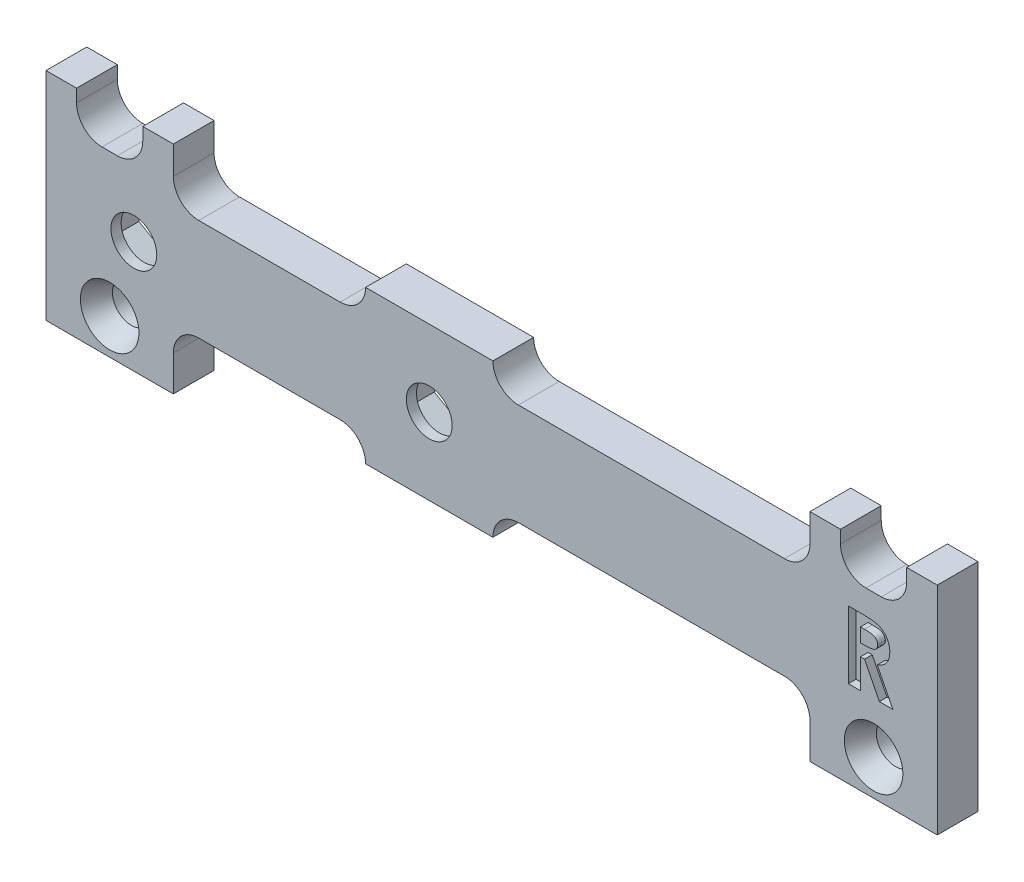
ISO-10303-21;
HEADER;
FILE_DESCRIPTION(('STEP AP214'),'2;1');
FILE_NAME('part.step','',(''),(''),'','','');
FILE_SCHEMA(('AUTOMOTIVE_DESIGN { 1 0 10303 214 1 1 1 1 }'));
ENDSEC;
DATA;
#1=APPLICATION_CONTEXT('core data for automotive mechanical design processes');
#2=APPLICATION_PROTOCOL_DEFINITION('international standard','automotive_design',2000,#1);
#3=PRODUCT_CONTEXT('',#1,'mechanical');
#4=PRODUCT('Part','Part','',(#3));
#5=PRODUCT_RELATED_PRODUCT_CATEGORY('part','',(#4));
#6=PRODUCT_DEFINITION_FORMATION('','',#4);
#7=PRODUCT_DEFINITION_CONTEXT('part definition',#1,'design');
#8=PRODUCT_DEFINITION('design','',#6,#7);
#9=PRODUCT_DEFINITION_SHAPE('','',#8);
#10=(LENGTH_UNIT() NAMED_UNIT(*) SI_UNIT(.MILLI.,.METRE.));
#11=(NAMED_UNIT(*) PLANE_ANGLE_UNIT() SI_UNIT($,.RADIAN.));
#12=(NAMED_UNIT(*) SI_UNIT($,.STERADIAN.) SOLID_ANGLE_UNIT());
#13=UNCERTAINTY_MEASURE_WITH_UNIT(LENGTH_MEASURE(1.E-05),#10,'distance_accuracy_value','');
#14=(GEOMETRIC_REPRESENTATION_CONTEXT(3) GLOBAL_UNCERTAINTY_ASSIGNED_CONTEXT((#13)) GLOBAL_UNIT_ASSIGNED_CONTEXT((#10,
#11,#12)) REPRESENTATION_CONTEXT('',''));
#15=CARTESIAN_POINT('',(0.,0.,0.));
#16=DIRECTION('',(0.,0.,1.));
#17=DIRECTION('',(1.,0.,0.));
#18=AXIS2_PLACEMENT_3D('',#15,#16,#17);
#19=CARTESIAN_POINT('',(0.,0.,3.2));
#20=DIRECTION('',(0.,0.,1.));
#21=DIRECTION('',(1.,0.,0.));
#22=AXIS2_PLACEMENT_3D('',#19,#20,#21);
#23=PLANE('',#22);
#24=DIRECTION('',(1.,0.,0.));
#25=VECTOR('',#24,1.);
#26=CARTESIAN_POINT('',(58.1327586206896,1.46120689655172,3.2));
#27=LINE('',#26,#25);
#28=CARTESIAN_POINT('',(60.1327586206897,1.46120689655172,3.2));
#29=VERTEX_POINT('',#28);
#30=CARTESIAN_POINT('',(61.3327586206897,1.46120689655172,3.2));
#31=VERTEX_POINT('',#30);
#32=EDGE_CURVE('E869',#29,#31,#27,.T.);
#33=ORIENTED_EDGE('',*,*,#32,.F.);
#34=CARTESIAN_POINT('',(60.1327586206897,3.46120689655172,3.2));
#35=DIRECTION('',(0.,0.,1.));
#36=DIRECTION('',(1.,0.,0.));
#37=AXIS2_PLACEMENT_3D('',#34,#35,#36);
#38=CIRCLE('',#37,2.);
#39=CARTESIAN_POINT('',(58.1327586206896,3.46120689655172,3.2));
#40=VERTEX_POINT('',#39);
#41=EDGE_CURVE('E1067',#29,#40,#38,.F.);
#42=ORIENTED_EDGE('',*,*,#41,.T.);
#43=DIRECTION('',(0.,-1.,0.));
#44=VECTOR('',#43,1.);
#45=CARTESIAN_POINT('',(58.1327586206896,4.46120689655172,3.2));
#46=LINE('',#45,#44);
#47=CARTESIAN_POINT('',(58.1327586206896,4.46120689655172,3.2));
#48=VERTEX_POINT('',#47);
#49=EDGE_CURVE('E872',#48,#40,#46,.T.);
#50=ORIENTED_EDGE('',*,*,#49,.F.);
#51=DIRECTION('',(-1.,0.,0.));
#52=VECTOR('',#51,1.);
#53=CARTESIAN_POINT('',(55.7327586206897,4.46120689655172,3.2));
#54=LINE('',#53,#52);
#55=CARTESIAN_POINT('',(55.7327586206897,4.46120689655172,3.2));
#56=VERTEX_POINT('',#55);
#57=EDGE_CURVE('E892',#48,#56,#54,.T.);
#58=ORIENTED_EDGE('',*,*,#57,.T.);
#59=DIRECTION('',(0.,-1.,0.));
#60=VECTOR('',#59,1.);
#61=CARTESIAN_POINT('',(55.7327586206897,-12.5387931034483,3.2));
#62=LINE('',#61,#60);
#63=CARTESIAN_POINT('',(55.7327586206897,2.26120689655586,3.2));
#64=VERTEX_POINT('',#63);
#65=EDGE_CURVE('E908',#56,#64,#62,.T.);
#66=ORIENTED_EDGE('',*,*,#65,.T.);
#67=CARTESIAN_POINT('',(53.7327586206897,2.26120689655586,3.2));
#68=DIRECTION('',(0.,0.,1.));
#69=DIRECTION('',(1.,0.,0.));
#70=AXIS2_PLACEMENT_3D('',#67,#68,#69);
#71=CIRCLE('',#70,2.);
#72=CARTESIAN_POINT('',(53.7327586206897,0.261206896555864,3.2));
#73=VERTEX_POINT('',#72);
#74=EDGE_CURVE('E1057',#64,#73,#71,.F.);
#75=ORIENTED_EDGE('',*,*,#74,.T.);
#76=DIRECTION('',(-1.,0.,0.));
#77=VECTOR('',#76,1.);
#78=CARTESIAN_POINT('',(5.73275862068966,0.261206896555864,3.2));
#79=LINE('',#78,#77);
#80=CARTESIAN_POINT('',(32.8327586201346,0.261206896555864,3.2));
#81=VERTEX_POINT('',#80);
#82=EDGE_CURVE('E955',#73,#81,#79,.T.);
#83=ORIENTED_EDGE('',*,*,#82,.T.);
#84=CARTESIAN_POINT('',(32.8327586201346,2.26120689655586,3.2));
#85=DIRECTION('',(0.,0.,1.));
#86=DIRECTION('',(1.,0.,0.));
#87=AXIS2_PLACEMENT_3D('',#84,#85,#86);
#88=CIRCLE('',#87,2.);
#89=CARTESIAN_POINT('',(30.8327586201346,2.26120689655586,3.2));
#90=VERTEX_POINT('',#89);
#91=EDGE_CURVE('E11',#81,#90,#88,.F.);
#92=ORIENTED_EDGE('',*,*,#91,.T.);
#93=DIRECTION('',(-1.,0.,0.));
#94=VECTOR('',#93,1.);
#95=CARTESIAN_POINT('',(30.8327586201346,2.26120689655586,3.2));
#96=LINE('',#95,#94);
#97=CARTESIAN_POINT('',(20.8327586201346,2.26120689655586,3.2));
#98=VERTEX_POINT('',#97);
#99=EDGE_CURVE('E834',#90,#98,#96,.T.);
#100=ORIENTED_EDGE('',*,*,#99,.T.);
#101=CARTESIAN_POINT('',(18.8327586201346,2.26120689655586,3.2));
#102=DIRECTION('',(0.,0.,1.));
#103=DIRECTION('',(1.,0.,0.));
#104=AXIS2_PLACEMENT_3D('',#101,#102,#103);
#105=CIRCLE('',#104,2.);
#106=CARTESIAN_POINT('',(18.8327586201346,0.261206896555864,3.2));
#107=VERTEX_POINT('',#106);
#108=EDGE_CURVE('E1097',#98,#107,#105,.F.);
#109=ORIENTED_EDGE('',*,*,#108,.T.);
#110=CARTESIAN_POINT('',(7.73275862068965,0.261206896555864,3.2));
#111=VERTEX_POINT('',#110);
#112=EDGE_CURVE('E941',#107,#111,#79,.T.);
#113=ORIENTED_EDGE('',*,*,#112,.T.);
#114=CARTESIAN_POINT('',(7.73275862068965,2.26120689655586,3.2));
#115=DIRECTION('',(0.,0.,1.));
#116=DIRECTION('',(1.,0.,0.));
#117=AXIS2_PLACEMENT_3D('',#114,#115,#116);
#118=CIRCLE('',#117,2.);
#119=CARTESIAN_POINT('',(5.73275862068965,2.26120689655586,3.2));
#120=VERTEX_POINT('',#119);
#121=EDGE_CURVE('E1055',#111,#120,#118,.F.);
#122=ORIENTED_EDGE('',*,*,#121,.T.);
#123=DIRECTION('',(0.,1.,0.));
#124=VECTOR('',#123,1.);
#125=CARTESIAN_POINT('',(5.73275862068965,4.46120689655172,3.2));
#126=LINE('',#125,#124);
#127=CARTESIAN_POINT('',(5.73275862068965,4.46120689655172,3.2));
#128=VERTEX_POINT('',#127);
#129=EDGE_CURVE('E970',#120,#128,#126,.T.);
#130=ORIENTED_EDGE('',*,*,#129,.T.);
#131=DIRECTION('',(-1.,0.,0.));
#132=VECTOR('',#131,1.);
#133=CARTESIAN_POINT('',(-4.26724137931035,4.46120689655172,3.2));
#134=LINE('',#133,#132);
#135=CARTESIAN_POINT('',(3.33275862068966,4.46120689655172,3.2));
#136=VERTEX_POINT('',#135);
#137=EDGE_CURVE('E975',#128,#136,#134,.T.);
#138=ORIENTED_EDGE('',*,*,#137,.T.);
#139=DIRECTION('',(0.,1.,0.));
#140=VECTOR('',#139,1.);
#141=CARTESIAN_POINT('',(3.33275862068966,4.46120689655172,3.2));
#142=LINE('',#141,#140);
#143=CARTESIAN_POINT('',(3.33275862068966,3.46120689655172,3.2));
#144=VERTEX_POINT('',#143);
#145=EDGE_CURVE('E893',#144,#136,#142,.T.);
#146=ORIENTED_EDGE('',*,*,#145,.F.);
#147=CARTESIAN_POINT('',(1.33275862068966,3.46120689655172,3.2));
#148=DIRECTION('',(0.,0.,1.));
#149=DIRECTION('',(1.,0.,0.));
#150=AXIS2_PLACEMENT_3D('',#147,#148,#149);
#151=CIRCLE('',#150,2.);
#152=CARTESIAN_POINT('',(1.33275862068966,1.46120689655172,3.2));
#153=VERTEX_POINT('',#152);
#154=EDGE_CURVE('E1071',#144,#153,#151,.F.);
#155=ORIENTED_EDGE('',*,*,#154,.T.);
#156=DIRECTION('',(1.,0.,0.));
#157=VECTOR('',#156,1.);
#158=CARTESIAN_POINT('',(3.33275862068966,1.46120689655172,3.2));
#159=LINE('',#158,#157);
#160=CARTESIAN_POINT('',(0.132758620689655,1.46120689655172,3.2));
#161=VERTEX_POINT('',#160);
#162=EDGE_CURVE('E882',#161,#153,#159,.T.);
#163=ORIENTED_EDGE('',*,*,#162,.F.);
#164=CARTESIAN_POINT('',(0.132758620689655,3.46120689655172,3.2));
#165=DIRECTION('',(0.,0.,1.));
#166=DIRECTION('',(1.,0.,0.));
#167=AXIS2_PLACEMENT_3D('',#164,#165,#166);
#168=CIRCLE('',#167,2.);
#169=CARTESIAN_POINT('',(-1.86724137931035,3.46120689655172,3.2));
#170=VERTEX_POINT('',#169);
#171=EDGE_CURVE('E1075',#161,#170,#168,.F.);
#172=ORIENTED_EDGE('',*,*,#171,.T.);
#173=DIRECTION('',(0.,-1.,0.));
#174=VECTOR('',#173,1.);
#175=CARTESIAN_POINT('',(-1.86724137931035,4.46120689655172,3.2));
#176=LINE('',#175,#174);
#177=CARTESIAN_POINT('',(-1.86724137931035,4.46120689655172,3.2));
#178=VERTEX_POINT('',#177);
#179=EDGE_CURVE('E889',#178,#170,#176,.T.);
#180=ORIENTED_EDGE('',*,*,#179,.F.);
#181=CARTESIAN_POINT('',(-4.26724137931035,4.46120689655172,3.2));
#182=VERTEX_POINT('',#181);
#183=EDGE_CURVE('E974',#178,#182,#134,.T.);
#184=ORIENTED_EDGE('',*,*,#183,.T.);
#185=DIRECTION('',(0.,-1.,0.));
#186=VECTOR('',#185,1.);
#187=CARTESIAN_POINT('',(-4.26724137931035,4.46120689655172,3.2));
#188=LINE('',#187,#186);
#189=CARTESIAN_POINT('',(-4.26724137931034,-12.5387931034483,3.2));
#190=VERTEX_POINT('',#189);
#191=EDGE_CURVE('E964',#182,#190,#188,.T.);
#192=ORIENTED_EDGE('',*,*,#191,.T.);
#193=DIRECTION('',(1.,0.,0.));
#194=VECTOR('',#193,1.);
#195=CARTESIAN_POINT('',(-4.26724137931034,-12.5387931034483,3.2));
#196=LINE('',#195,#194);
#197=CARTESIAN_POINT('',(5.73275862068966,-12.5387931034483,3.2));
#198=VERTEX_POINT('',#197);
#199=EDGE_CURVE('E967',#190,#198,#196,.T.);
#200=ORIENTED_EDGE('',*,*,#199,.T.);
#201=CARTESIAN_POINT('',(5.73275862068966,-9.73879310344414,3.2));
#202=VERTEX_POINT('',#201);
#203=EDGE_CURVE('E971',#198,#202,#126,.T.);
#204=ORIENTED_EDGE('',*,*,#203,.T.);
#205=CARTESIAN_POINT('',(7.73275862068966,-9.73879310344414,3.2));
#206=DIRECTION('',(0.,0.,1.));
#207=DIRECTION('',(1.,0.,0.));
#208=AXIS2_PLACEMENT_3D('',#205,#206,#207);
#209=CIRCLE('',#208,2.);
#210=CARTESIAN_POINT('',(7.73275862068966,-7.73879310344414,3.2));
#211=VERTEX_POINT('',#210);
#212=EDGE_CURVE('E1050',#202,#211,#209,.F.);
#213=ORIENTED_EDGE('',*,*,#212,.T.);
#214=DIRECTION('',(1.,0.,0.));
#215=VECTOR('',#214,1.);
#216=CARTESIAN_POINT('',(5.73275862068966,-7.73879310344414,3.2));
#217=LINE('',#216,#215);
#218=CARTESIAN_POINT('',(18.8327586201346,-7.73879310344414,3.2));
#219=VERTEX_POINT('',#218);
#220=EDGE_CURVE('E951',#211,#219,#217,.T.);
#221=ORIENTED_EDGE('',*,*,#220,.T.);
#222=CARTESIAN_POINT('',(18.8327586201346,-9.73879310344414,3.2));
#223=DIRECTION('',(0.,0.,1.));
#224=DIRECTION('',(1.,0.,0.));
#225=AXIS2_PLACEMENT_3D('',#222,#223,#224);
#226=CIRCLE('',#225,2.);
#227=CARTESIAN_POINT('',(20.8327586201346,-9.73879310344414,3.2));
#228=VERTEX_POINT('',#227);
#229=EDGE_CURVE('E1089',#219,#228,#226,.F.);
#230=ORIENTED_EDGE('',*,*,#229,.T.);
#231=DIRECTION('',(1.,0.,0.));
#232=VECTOR('',#231,1.);
#233=CARTESIAN_POINT('',(30.8327586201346,-9.73879310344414,3.2));
#234=LINE('',#233,#232);
#235=CARTESIAN_POINT('',(30.8327586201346,-9.73879310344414,3.2));
#236=VERTEX_POINT('',#235);
#237=EDGE_CURVE('E820',#228,#236,#234,.T.);
#238=ORIENTED_EDGE('',*,*,#237,.T.);
#239=CARTESIAN_POINT('',(32.8327586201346,-9.73879310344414,3.2));
#240=DIRECTION('',(0.,0.,1.));
#241=DIRECTION('',(1.,0.,0.));
#242=AXIS2_PLACEMENT_3D('',#239,#240,#241);
#243=CIRCLE('',#242,2.);
#244=CARTESIAN_POINT('',(32.8327586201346,-7.73879310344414,3.2));
#245=VERTEX_POINT('',#244);
#246=EDGE_CURVE('E1093',#236,#245,#243,.F.);
#247=ORIENTED_EDGE('',*,*,#246,.T.);
#248=CARTESIAN_POINT('',(53.7327586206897,-7.73879310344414,3.2));
#249=VERTEX_POINT('',#248);
#250=EDGE_CURVE('E954',#245,#249,#217,.T.);
#251=ORIENTED_EDGE('',*,*,#250,.T.);
#252=CARTESIAN_POINT('',(53.7327586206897,-9.73879310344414,3.2));
#253=DIRECTION('',(0.,0.,1.));
#254=DIRECTION('',(1.,0.,0.));
#255=AXIS2_PLACEMENT_3D('',#252,#253,#254);
#256=CIRCLE('',#255,2.);
#257=CARTESIAN_POINT('',(55.7327586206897,-9.73879310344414,3.2));
#258=VERTEX_POINT('',#257);
#259=EDGE_CURVE('E1046',#249,#258,#256,.F.);
#260=ORIENTED_EDGE('',*,*,#259,.T.);
#261=CARTESIAN_POINT('',(55.7327586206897,-12.5387931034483,3.2));
#262=VERTEX_POINT('',#261);
#263=EDGE_CURVE('E907',#258,#262,#62,.T.);
#264=ORIENTED_EDGE('',*,*,#263,.T.);
#265=DIRECTION('',(1.,0.,0.));
#266=VECTOR('',#265,1.);
#267=CARTESIAN_POINT('',(55.7327586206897,-12.5387931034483,3.2));
#268=LINE('',#267,#266);
#269=CARTESIAN_POINT('',(65.7327586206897,-12.5387931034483,3.2));
#270=VERTEX_POINT('',#269);
#271=EDGE_CURVE('E904',#262,#270,#268,.T.);
#272=ORIENTED_EDGE('',*,*,#271,.T.);
#273=DIRECTION('',(0.,1.,0.));
#274=VECTOR('',#273,1.);
#275=CARTESIAN_POINT('',(65.7327586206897,0.261206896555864,3.2));
#276=LINE('',#275,#274);
#277=CARTESIAN_POINT('',(65.7327586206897,4.46120689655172,3.2));
#278=VERTEX_POINT('',#277);
#279=EDGE_CURVE('E948',#270,#278,#276,.T.);
#280=ORIENTED_EDGE('',*,*,#279,.T.);
#281=CARTESIAN_POINT('',(63.3327586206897,4.46120689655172,3.2));
#282=VERTEX_POINT('',#281);
#283=EDGE_CURVE('E901',#278,#282,#54,.T.);
#284=ORIENTED_EDGE('',*,*,#283,.T.);
#285=DIRECTION('',(0.,1.,0.));
#286=VECTOR('',#285,1.);
#287=CARTESIAN_POINT('',(63.3327586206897,4.46120689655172,3.2));
#288=LINE('',#287,#286);
#289=CARTESIAN_POINT('',(63.3327586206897,3.46120689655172,3.2));
#290=VERTEX_POINT('',#289);
#291=EDGE_CURVE('E866',#290,#282,#288,.T.);
#292=ORIENTED_EDGE('',*,*,#291,.F.);
#293=CARTESIAN_POINT('',(61.3327586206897,3.46120689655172,3.2));
#294=DIRECTION('',(0.,0.,1.));
#295=DIRECTION('',(1.,0.,0.));
#296=AXIS2_PLACEMENT_3D('',#293,#294,#295);
#297=CIRCLE('',#296,2.);
#298=EDGE_CURVE('E1063',#290,#31,#297,.F.);
#299=ORIENTED_EDGE('',*,*,#298,.T.);
#300=EDGE_LOOP('',(#33,#42,#50,#58,#66,#75,#83,#92,#100,#109,#113,#122,#130,#138,#146,#155,#163,
#172,#180,#184,#192,#200,#204,#213,#221,#230,#238,#247,#251,#260,#264,#272,#280,#284,#292,#299));
#301=FACE_BOUND('',#300,.T.);
#302=CARTESIAN_POINT('',(2.6327586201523,-3.73879310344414,3.2));
#303=DIRECTION('',(0.,0.,1.));
#304=DIRECTION('',(1.,0.,0.));
#305=AXIS2_PLACEMENT_3D('',#302,#303,#304);
#306=CIRCLE('',#305,1.8);
#307=CARTESIAN_POINT('',(4.4327586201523,-3.73879310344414,3.2));
#308=VERTEX_POINT('',#307);
#309=EDGE_CURVE('E950',#308,#308,#306,.T.);
#310=ORIENTED_EDGE('',*,*,#309,.F.);
#311=EDGE_LOOP('',(#310));
#312=FACE_BOUND('',#311,.T.);
#313=CARTESIAN_POINT('',(60.7327586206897,-9.73879310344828,3.2));
#314=DIRECTION('',(0.,0.,1.));
#315=DIRECTION('',(1.,0.,0.));
#316=AXIS2_PLACEMENT_3D('',#313,#314,#315);
#317=CIRCLE('',#316,2.3);
#318=CARTESIAN_POINT('',(63.0327586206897,-9.73879310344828,3.2));
#319=VERTEX_POINT('',#318);
#320=EDGE_CURVE('E850',#319,#319,#317,.T.);
#321=ORIENTED_EDGE('',*,*,#320,.F.);
#322=EDGE_LOOP('',(#321));
#323=FACE_BOUND('',#322,.T.);
#324=CARTESIAN_POINT('',(0.732758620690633,-9.73879310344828,3.2));
#325=DIRECTION('',(0.,0.,1.));
#326=DIRECTION('',(1.,0.,0.));
#327=AXIS2_PLACEMENT_3D('',#324,#325,#326);
#328=CIRCLE('',#327,2.3);
#329=CARTESIAN_POINT('',(3.03275862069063,-9.73879310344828,3.2));
#330=VERTEX_POINT('',#329);
#331=EDGE_CURVE('E844',#330,#330,#328,.T.);
#332=ORIENTED_EDGE('',*,*,#331,.F.);
#333=EDGE_LOOP('',(#332));
#334=FACE_BOUND('',#333,.T.);
#335=CARTESIAN_POINT('',(25.8327586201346,-3.7387931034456,3.2));
#336=DIRECTION('',(0.,0.,1.));
#337=DIRECTION('',(1.,0.,0.));
#338=AXIS2_PLACEMENT_3D('',#335,#336,#337);
#339=CIRCLE('',#338,1.80000000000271);
#340=CARTESIAN_POINT('',(27.6327586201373,-3.7387931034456,3.2));
#341=VERTEX_POINT('',#340);
#342=EDGE_CURVE('E837',#341,#341,#339,.T.);
#343=ORIENTED_EDGE('',*,*,#342,.F.);
#344=EDGE_LOOP('',(#343));
#345=FACE_BOUND('',#344,.T.);
#346=DIRECTION('',(-1.,0.,0.));
#347=VECTOR('',#346,1.);
#348=CARTESIAN_POINT('',(59.6991228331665,-5.73879310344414,3.2));
#349=LINE('',#348,#347);
#350=CARTESIAN_POINT('',(59.6991228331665,-5.73879310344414,3.2));
#351=VERTEX_POINT('',#350);
#352=CARTESIAN_POINT('',(58.7493365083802,-5.73879310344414,3.2));
#353=VERTEX_POINT('',#352);
#354=EDGE_CURVE('E633',#351,#353,#349,.T.);
#355=ORIENTED_EDGE('',*,*,#354,.T.);
#356=DIRECTION('',(0.,1.,0.));
#357=VECTOR('',#356,1.);
#358=CARTESIAN_POINT('',(58.7493365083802,-5.73879310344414,3.2));
#359=LINE('',#358,#357);
#360=CARTESIAN_POINT('',(58.7493365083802,-0.447126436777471,3.2));
#361=VERTEX_POINT('',#360);
#362=EDGE_CURVE('E51',#353,#361,#359,.T.);
#363=ORIENTED_EDGE('',*,*,#362,.T.);
#364=DIRECTION('',(1.,0.,0.));
#365=VECTOR('',#364,1.);
#366=CARTESIAN_POINT('',(58.7493365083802,-0.447126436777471,3.2));
#367=LINE('',#366,#365);
#368=CARTESIAN_POINT('',(59.8560071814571,-0.447126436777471,3.2));
#369=VERTEX_POINT('',#368);
#370=EDGE_CURVE('E599',#361,#369,#367,.T.);
#371=ORIENTED_EDGE('',*,*,#370,.T.);
#372=CARTESIAN_POINT('',(59.8560071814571,-0.447126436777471,3.2));
#373=CARTESIAN_POINT('',(59.9291577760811,-0.44738607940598,3.2));
#374=CARTESIAN_POINT('',(60.0698469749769,-0.447885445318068,3.2));
#375=CARTESIAN_POINT('',(60.2727131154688,-0.455764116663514,3.2));
#376=CARTESIAN_POINT('',(60.4590735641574,-0.466727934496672,3.2));
#377=CARTESIAN_POINT('',(60.6292042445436,-0.483459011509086,3.2));
#378=CARTESIAN_POINT('',(60.7830323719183,-0.505642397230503,3.2));
#379=CARTESIAN_POINT('',(60.9207121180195,-0.531792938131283,3.2));
#380=CARTESIAN_POINT('',(61.0422394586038,-0.561597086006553,3.2));
#381=CARTESIAN_POINT('',(61.1486393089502,-0.598735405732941,3.2));
#382=CARTESIAN_POINT('',(61.2446599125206,-0.640626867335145,3.2));
#383=CARTESIAN_POINT('',(61.3341644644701,-0.688760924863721,3.2));
#384=CARTESIAN_POINT('',(61.4191275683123,-0.742601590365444,3.2));
#385=CARTESIAN_POINT('',(61.4989813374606,-0.80356555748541,3.2));
#386=CARTESIAN_POINT('',(61.5744197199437,-0.870556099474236,3.2));
#387=CARTESIAN_POINT('',(61.6455850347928,-0.943640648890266,3.2));
#388=CARTESIAN_POINT('',(61.7114716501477,-1.02343893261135,3.2));
#389=CARTESIAN_POINT('',(61.7716715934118,-1.10944672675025,3.2));
#390=CARTESIAN_POINT('',(61.8265389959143,-1.19992495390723,3.2));
#391=CARTESIAN_POINT('',(61.875030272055,-1.29499784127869,3.2));
#392=CARTESIAN_POINT('',(61.9144634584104,-1.39473150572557,3.2));
#393=CARTESIAN_POINT('',(61.9493069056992,-1.49768458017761,3.2));
#394=CARTESIAN_POINT('',(61.9744035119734,-1.60532879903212,3.2));
#395=CARTESIAN_POINT('',(61.9918578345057,-1.71661622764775,3.2));
#396=CARTESIAN_POINT('',(62.0046372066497,-1.83193860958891,3.2));
#397=CARTESIAN_POINT('',(62.0053719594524,-1.91028351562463,3.2));
#398=CARTESIAN_POINT('',(62.0057467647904,-1.95024809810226,3.2));
#399=B_SPLINE_CURVE_WITH_KNOTS('',3,(#372,#373,#374,#375,#376,#377,#378,#379,#380,#381,#382,
#383,#384,#385,#386,#387,#388,#389,#390,#391,#392,#393,#394,#395,#396,#397,#398),.UNSPECIFIED.,
.F.,.F.,(4,1,1,1,1,1,1,1,1,1,1,1,1,1,1,1,1,1,1,1,1,1,1,1,4),(0.,0.0728890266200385,
0.140186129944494,0.202277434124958,0.258895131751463,0.310482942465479,0.357095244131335,
0.398513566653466,0.435037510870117,0.469251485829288,0.502805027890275,0.536210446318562,
0.569379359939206,0.602801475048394,0.636665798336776,0.670928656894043,0.705803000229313,
0.741189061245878,0.776304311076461,0.812004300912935,0.847968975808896,0.884521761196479,
0.921974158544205,0.960198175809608,1.),.UNSPECIFIED.);
#400=CARTESIAN_POINT('',(62.0057467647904,-1.95024809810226,3.2));
#401=VERTEX_POINT('',#400);
#402=EDGE_CURVE('E602',#369,#401,#399,.T.);
#403=ORIENTED_EDGE('',*,*,#402,.T.);
#404=CARTESIAN_POINT('',(62.0057467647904,-1.95024809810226,3.2));
#405=CARTESIAN_POINT('',(62.0047731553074,-1.99196194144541,3.2));
#406=CARTESIAN_POINT('',(62.00286408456,-2.07375518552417,3.2));
#407=CARTESIAN_POINT('',(61.9925807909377,-2.19390279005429,3.2));
#408=CARTESIAN_POINT('',(61.9737861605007,-2.30885161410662,3.2));
#409=CARTESIAN_POINT('',(61.9453189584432,-2.41826510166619,3.2));
#410=CARTESIAN_POINT('',(61.9125996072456,-2.52350503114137,3.2));
#411=CARTESIAN_POINT('',(61.8690912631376,-2.62262966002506,3.2));
#412=CARTESIAN_POINT('',(61.8199877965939,-2.71708061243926,3.2));
#413=CARTESIAN_POINT('',(61.761669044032,-2.80552184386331,3.2));
#414=CARTESIAN_POINT('',(61.697667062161,-2.889917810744,3.2));
#415=CARTESIAN_POINT('',(61.6232341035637,-2.96703499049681,3.2));
#416=CARTESIAN_POINT('',(61.5431922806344,-3.04101813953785,3.2));
#417=CARTESIAN_POINT('',(61.453042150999,-3.10723320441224,3.2));
#418=CARTESIAN_POINT('',(61.3567576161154,-3.17015740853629,3.2));
#419=CARTESIAN_POINT('',(61.2524256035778,-3.22718349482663,3.2));
#420=CARTESIAN_POINT('',(61.140727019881,-3.27974496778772,3.2));
#421=CARTESIAN_POINT('',(61.0621973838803,-3.30905687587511,3.2));
#422=CARTESIAN_POINT('',(61.0220394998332,-3.32404617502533,3.2));
#423=B_SPLINE_CURVE_WITH_KNOTS('',3,(#404,#405,#406,#407,#408,#409,#410,#411,#412,#413,#414,
#415,#416,#417,#418,#419,#420,#421,#422),.UNSPECIFIED.,.F.,.F.,(4,1,1,1,1,1,1,1,1,1,1,1,1,1,1,1,
4),(0.,0.0687412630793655,0.134789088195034,0.198536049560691,0.26038565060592,
0.320961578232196,0.379903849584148,0.438502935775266,0.496154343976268,0.554265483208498,
0.612748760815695,0.672513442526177,0.733646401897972,0.796789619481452,0.861935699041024,
0.929397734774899,1.),.UNSPECIFIED.);
#424=CARTESIAN_POINT('',(61.0220394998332,-3.32404617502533,3.2));
#425=VERTEX_POINT('',#424);
#426=EDGE_CURVE('E607',#401,#425,#423,.T.);
#427=ORIENTED_EDGE('',*,*,#426,.T.);
#428=DIRECTION('',(0.451283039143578,-0.892380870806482,0.));
#429=VECTOR('',#428,1.);
#430=CARTESIAN_POINT('',(61.0220394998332,-3.32404617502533,3.2));
#431=LINE('',#430,#429);
#432=CARTESIAN_POINT('',(62.243193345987,-5.73879310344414,3.2));
#433=VERTEX_POINT('',#432);
#434=EDGE_CURVE('E615',#425,#433,#431,.T.);
#435=ORIENTED_EDGE('',*,*,#434,.T.);
#436=DIRECTION('',(-1.,0.,0.));
#437=VECTOR('',#436,1.);
#438=CARTESIAN_POINT('',(62.243193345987,-5.73879310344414,3.2));
#439=LINE('',#438,#437);
#440=CARTESIAN_POINT('',(61.1874040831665,-5.73879310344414,3.2));
#441=VERTEX_POINT('',#440);
#442=EDGE_CURVE('E621',#433,#441,#439,.T.);
#443=ORIENTED_EDGE('',*,*,#442,.T.);
#444=DIRECTION('',(-0.451146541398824,0.892449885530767,0.));
#445=VECTOR('',#444,1.);
#446=CARTESIAN_POINT('',(61.1874040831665,-5.73879310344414,3.2));
#447=LINE('',#446,#445);
#448=CARTESIAN_POINT('',(60.0213717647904,-3.43216917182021,3.2));
#449=VERTEX_POINT('',#448);
#450=EDGE_CURVE('E624',#441,#449,#447,.T.);
#451=ORIENTED_EDGE('',*,*,#450,.T.);
#452=DIRECTION('',(-1.,0.,0.));
#453=VECTOR('',#452,1.);
#454=CARTESIAN_POINT('',(60.0213717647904,-3.43216917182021,3.2));
#455=LINE('',#454,#453);
#456=CARTESIAN_POINT('',(59.6991228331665,-3.43216917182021,3.2));
#457=VERTEX_POINT('',#456);
#458=EDGE_CURVE('E627',#449,#457,#455,.T.);
#459=ORIENTED_EDGE('',*,*,#458,.T.);
#460=DIRECTION('',(0.,-1.,0.));
#461=VECTOR('',#460,1.);
#462=CARTESIAN_POINT('',(59.6991228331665,-3.43216917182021,3.2));
#463=LINE('',#462,#461);
#464=EDGE_CURVE('E630',#457,#351,#463,.T.);
#465=ORIENTED_EDGE('',*,*,#464,.T.);
#466=EDGE_LOOP('',(#355,#363,#371,#403,#427,#435,#443,#451,#459,#465));
#467=FACE_BOUND('',#466,.T.);
#468=ADVANCED_FACE('F34',(#301,#312,#323,#334,#345,#467),#23,.T.);
#469=CARTESIAN_POINT('',(25.8327586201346,-3.7387931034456,8.2911688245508));
#470=DIRECTION('',(0.,0.,-1.));
#471=DIRECTION('',(-1.,0.,0.));
#472=AXIS2_PLACEMENT_3D('',#469,#470,#471);
#473=CYLINDRICAL_SURFACE('',#472,1.80000000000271);
#474=ORIENTED_EDGE('',*,*,#342,.T.);
#475=EDGE_LOOP('',(#474));
#476=FACE_BOUND('',#475,.T.);
#477=CARTESIAN_POINT('',(25.8327586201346,-3.7387931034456,2.4));
#478=DIRECTION('',(0.,0.,-1.));
#479=DIRECTION('',(-1.,0.,0.));
#480=AXIS2_PLACEMENT_3D('',#477,#478,#479);
#481=CIRCLE('',#480,1.80000000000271);
#482=CARTESIAN_POINT('',(24.0327586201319,-3.7387931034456,2.4));
#483=VERTEX_POINT('',#482);
#484=EDGE_CURVE('E38',#483,#483,#481,.T.);
#485=ORIENTED_EDGE('',*,*,#484,.T.);
#486=EDGE_LOOP('',(#485));
#487=FACE_BOUND('',#486,.T.);
#488=ADVANCED_FACE('F1313',(#476,#487),#473,.F.);
#489=CARTESIAN_POINT('',(2.6327586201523,-3.73879310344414,8.29116882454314));
#490=DIRECTION('',(0.,0.,-1.));
#491=DIRECTION('',(-1.,0.,0.));
#492=AXIS2_PLACEMENT_3D('',#489,#490,#491);
#493=CYLINDRICAL_SURFACE('',#492,1.8);
#494=ORIENTED_EDGE('',*,*,#309,.T.);
#495=EDGE_LOOP('',(#494));
#496=FACE_BOUND('',#495,.T.);
#497=CARTESIAN_POINT('',(2.6327586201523,-3.73879310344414,2.4));
#498=DIRECTION('',(0.,0.,-1.));
#499=DIRECTION('',(-1.,0.,0.));
#500=AXIS2_PLACEMENT_3D('',#497,#498,#499);
#501=CIRCLE('',#500,1.8);
#502=CARTESIAN_POINT('',(0.832758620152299,-3.73879310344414,2.4));
#503=VERTEX_POINT('',#502);
#504=EDGE_CURVE('E806',#503,#503,#501,.T.);
#505=ORIENTED_EDGE('',*,*,#504,.T.);
#506=EDGE_LOOP('',(#505));
#507=FACE_BOUND('',#506,.T.);
#508=ADVANCED_FACE('F1102',(#496,#507),#493,.F.);
#509=CARTESIAN_POINT('',(5.73275862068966,-7.73879310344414,63.7309838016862));
#510=DIRECTION('',(0.,1.,0.));
#511=DIRECTION('',(0.,0.,1.));
#512=AXIS2_PLACEMENT_3D('',#509,#510,#511);
#513=PLANE('',#512);
#514=ORIENTED_EDGE('',*,*,#250,.F.);
#515=DIRECTION('',(0.,0.,-1.));
#516=VECTOR('',#515,1.);
#517=CARTESIAN_POINT('',(32.8327586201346,-7.73879310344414,0.));
#518=LINE('',#517,#516);
#519=CARTESIAN_POINT('',(32.8327586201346,-7.73879310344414,0.));
#520=VERTEX_POINT('',#519);
#521=EDGE_CURVE('E1079',#245,#520,#518,.T.);
#522=ORIENTED_EDGE('',*,*,#521,.T.);
#523=DIRECTION('',(1.,0.,0.));
#524=VECTOR('',#523,1.);
#525=CARTESIAN_POINT('',(5.73275862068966,-7.73879310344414,0.));
#526=LINE('',#525,#524);
#527=CARTESIAN_POINT('',(53.7327586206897,-7.73879310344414,0.));
#528=VERTEX_POINT('',#527);
#529=EDGE_CURVE('E937',#520,#528,#526,.T.);
#530=ORIENTED_EDGE('',*,*,#529,.T.);
#531=DIRECTION('',(0.,0.,-1.));
#532=VECTOR('',#531,1.);
#533=CARTESIAN_POINT('',(53.7327586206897,-7.73879310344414,3.2));
#534=LINE('',#533,#532);
#535=EDGE_CURVE('E1007',#528,#249,#534,.F.);
#536=ORIENTED_EDGE('',*,*,#535,.T.);
#537=EDGE_LOOP('',(#514,#522,#530,#536));
#538=FACE_BOUND('',#537,.T.);
#539=ADVANCED_FACE('F1200',(#538),#513,.F.);
#540=CARTESIAN_POINT('',(7.73275862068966,-7.73879310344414,0.));
#541=VERTEX_POINT('',#540);
#542=CARTESIAN_POINT('',(18.8327586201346,-7.73879310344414,0.));
#543=VERTEX_POINT('',#542);
#544=EDGE_CURVE('E945',#541,#543,#526,.T.);
#545=ORIENTED_EDGE('',*,*,#544,.T.);
#546=DIRECTION('',(0.,0.,-1.));
#547=VECTOR('',#546,1.);
#548=CARTESIAN_POINT('',(18.8327586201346,-7.73879310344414,3.2));
#549=LINE('',#548,#547);
#550=EDGE_CURVE('E1077',#543,#219,#549,.F.);
#551=ORIENTED_EDGE('',*,*,#550,.T.);
#552=ORIENTED_EDGE('',*,*,#220,.F.);
#553=DIRECTION('',(0.,0.,-1.));
#554=VECTOR('',#553,1.);
#555=CARTESIAN_POINT('',(7.73275862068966,-7.73879310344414,0.));
#556=LINE('',#555,#554);
#557=EDGE_CURVE('E1004',#211,#541,#556,.T.);
#558=ORIENTED_EDGE('',*,*,#557,.T.);
#559=EDGE_LOOP('',(#545,#551,#552,#558));
#560=FACE_BOUND('',#559,.T.);
#561=ADVANCED_FACE('F1216',(#560),#513,.F.);
#562=CARTESIAN_POINT('',(5.73275862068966,0.261206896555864,63.7309838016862));
#563=DIRECTION('',(0.,-1.,0.));
#564=DIRECTION('',(0.,0.,-1.));
#565=AXIS2_PLACEMENT_3D('',#562,#563,#564);
#566=PLANE('',#565);
#567=DIRECTION('',(-1.,0.,0.));
#568=VECTOR('',#567,1.);
#569=CARTESIAN_POINT('',(5.73275862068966,0.261206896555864,0.));
#570=LINE('',#569,#568);
#571=CARTESIAN_POINT('',(53.7327586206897,0.261206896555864,0.));
#572=VERTEX_POINT('',#571);
#573=CARTESIAN_POINT('',(32.8327586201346,0.261206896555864,0.));
#574=VERTEX_POINT('',#573);
#575=EDGE_CURVE('E938',#572,#574,#570,.T.);
#576=ORIENTED_EDGE('',*,*,#575,.T.);
#577=DIRECTION('',(0.,0.,-1.));
#578=VECTOR('',#577,1.);
#579=CARTESIAN_POINT('',(32.8327586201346,0.261206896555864,3.2));
#580=LINE('',#579,#578);
#581=EDGE_CURVE('E1085',#574,#81,#580,.F.);
#582=ORIENTED_EDGE('',*,*,#581,.T.);
#583=ORIENTED_EDGE('',*,*,#82,.F.);
#584=DIRECTION('',(0.,0.,1.));
#585=VECTOR('',#584,1.);
#586=CARTESIAN_POINT('',(53.7327586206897,0.261206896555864,0.));
#587=LINE('',#586,#585);
#588=EDGE_CURVE('E1015',#73,#572,#587,.F.);
#589=ORIENTED_EDGE('',*,*,#588,.T.);
#590=EDGE_LOOP('',(#576,#582,#583,#589));
#591=FACE_BOUND('',#590,.T.);
#592=ADVANCED_FACE('F1295',(#591),#566,.F.);
#593=ORIENTED_EDGE('',*,*,#112,.F.);
#594=DIRECTION('',(0.,0.,-1.));
#595=VECTOR('',#594,1.);
#596=CARTESIAN_POINT('',(18.8327586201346,0.261206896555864,0.));
#597=LINE('',#596,#595);
#598=CARTESIAN_POINT('',(18.8327586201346,0.261206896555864,0.));
#599=VERTEX_POINT('',#598);
#600=EDGE_CURVE('E1082',#107,#599,#597,.T.);
#601=ORIENTED_EDGE('',*,*,#600,.T.);
#602=CARTESIAN_POINT('',(7.73275862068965,0.261206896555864,0.));
#603=VERTEX_POINT('',#602);
#604=EDGE_CURVE('E942',#599,#603,#570,.T.);
#605=ORIENTED_EDGE('',*,*,#604,.T.);
#606=DIRECTION('',(0.,0.,-1.));
#607=VECTOR('',#606,1.);
#608=CARTESIAN_POINT('',(7.73275862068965,0.261206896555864,3.2));
#609=LINE('',#608,#607);
#610=EDGE_CURVE('E1017',#603,#111,#609,.F.);
#611=ORIENTED_EDGE('',*,*,#610,.T.);
#612=EDGE_LOOP('',(#593,#601,#605,#611));
#613=FACE_BOUND('',#612,.T.);
#614=ADVANCED_FACE('F1279',(#613),#566,.F.);
#615=CARTESIAN_POINT('',(0.732758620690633,-9.73879310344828,5.4));
#616=DIRECTION('',(0.,0.,-1.));
#617=DIRECTION('',(-1.,0.,0.));
#618=AXIS2_PLACEMENT_3D('',#615,#616,#617);
#619=CYLINDRICAL_SURFACE('',#618,1.5);
#620=CARTESIAN_POINT('',(0.732758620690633,-9.73879310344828,0.));
#621=DIRECTION('',(0.,0.,1.));
#622=DIRECTION('',(1.,0.,0.));
#623=AXIS2_PLACEMENT_3D('',#620,#621,#622);
#624=CIRCLE('',#623,1.5);
#625=CARTESIAN_POINT('',(2.23275862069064,-9.73879310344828,0.));
#626=VERTEX_POINT('',#625);
#627=EDGE_CURVE('E960',#626,#626,#624,.T.);
#628=ORIENTED_EDGE('',*,*,#627,.F.);
#629=EDGE_LOOP('',(#628));
#630=FACE_BOUND('',#629,.T.);
#631=CARTESIAN_POINT('',(0.732758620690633,-9.73879310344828,1.48439446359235));
#632=DIRECTION('',(0.,0.,1.));
#633=DIRECTION('',(1.,0.,0.));
#634=AXIS2_PLACEMENT_3D('',#631,#632,#633);
#635=CIRCLE('',#634,1.5);
#636=CARTESIAN_POINT('',(2.23275862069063,-9.73879310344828,1.48439446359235));
#637=VERTEX_POINT('',#636);
#638=EDGE_CURVE('E847',#637,#637,#635,.T.);
#639=ORIENTED_EDGE('',*,*,#638,.T.);
#640=EDGE_LOOP('',(#639));
#641=FACE_BOUND('',#640,.T.);
#642=ADVANCED_FACE('F1498',(#630,#641),#619,.F.);
#643=CARTESIAN_POINT('',(60.7327586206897,-9.73879310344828,22.923082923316));
#644=DIRECTION('',(0.,0.,-1.));
#645=DIRECTION('',(-1.,0.,0.));
#646=AXIS2_PLACEMENT_3D('',#643,#644,#645);
#647=CYLINDRICAL_SURFACE('',#646,1.49999999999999);
#648=CARTESIAN_POINT('',(60.7327586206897,-9.73879310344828,0.));
#649=DIRECTION('',(0.,0.,1.));
#650=DIRECTION('',(1.,0.,0.));
#651=AXIS2_PLACEMENT_3D('',#648,#649,#650);
#652=CIRCLE('',#651,1.49999999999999);
#653=CARTESIAN_POINT('',(62.2327586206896,-9.73879310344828,0.));
#654=VERTEX_POINT('',#653);
#655=EDGE_CURVE('E911',#654,#654,#652,.T.);
#656=ORIENTED_EDGE('',*,*,#655,.F.);
#657=EDGE_LOOP('',(#656));
#658=FACE_BOUND('',#657,.T.);
#659=CARTESIAN_POINT('',(60.7327586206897,-9.73879310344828,1.48439446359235));
#660=DIRECTION('',(0.,0.,1.));
#661=DIRECTION('',(1.,0.,0.));
#662=AXIS2_PLACEMENT_3D('',#659,#660,#661);
#663=CIRCLE('',#662,1.5);
#664=CARTESIAN_POINT('',(62.2327586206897,-9.73879310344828,1.48439446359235));
#665=VERTEX_POINT('',#664);
#666=EDGE_CURVE('E853',#665,#665,#663,.T.);
#667=ORIENTED_EDGE('',*,*,#666,.T.);
#668=EDGE_LOOP('',(#667));
#669=FACE_BOUND('',#668,.T.);
#670=ADVANCED_FACE('F1138',(#658,#669),#647,.F.);
#671=CARTESIAN_POINT('',(0.,0.,0.));
#672=DIRECTION('',(0.,0.,1.));
#673=DIRECTION('',(1.,0.,0.));
#674=AXIS2_PLACEMENT_3D('',#671,#672,#673);
#675=PLANE('',#674);
#676=DIRECTION('',(-1.,0.,0.));
#677=VECTOR('',#676,1.);
#678=CARTESIAN_POINT('',(20.0327586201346,-5.13879310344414,0.));
#679=LINE('',#678,#677);
#680=CARTESIAN_POINT('',(20.0327586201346,-5.13879310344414,0.));
#681=VERTEX_POINT('',#680);
#682=CARTESIAN_POINT('',(8.4327586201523,-5.13879310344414,0.));
#683=VERTEX_POINT('',#682);
#684=EDGE_CURVE('E672',#681,#683,#679,.T.);
#685=ORIENTED_EDGE('',*,*,#684,.F.);
#686=DIRECTION('',(0.,-1.,0.));
#687=VECTOR('',#686,1.);
#688=CARTESIAN_POINT('',(20.0327586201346,-2.33879310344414,0.));
#689=LINE('',#688,#687);
#690=CARTESIAN_POINT('',(20.0327586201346,-2.33879310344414,0.));
#691=VERTEX_POINT('',#690);
#692=EDGE_CURVE('E656',#691,#681,#689,.T.);
#693=ORIENTED_EDGE('',*,*,#692,.F.);
#694=DIRECTION('',(1.,0.,0.));
#695=VECTOR('',#694,1.);
#696=CARTESIAN_POINT('',(20.0327586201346,-2.33879310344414,0.));
#697=LINE('',#696,#695);
#698=CARTESIAN_POINT('',(8.4327586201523,-2.33879310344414,0.));
#699=VERTEX_POINT('',#698);
#700=EDGE_CURVE('E661',#699,#691,#697,.T.);
#701=ORIENTED_EDGE('',*,*,#700,.F.);
#702=DIRECTION('',(0.,1.,0.));
#703=VECTOR('',#702,1.);
#704=CARTESIAN_POINT('',(8.4327586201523,-2.33879310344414,0.));
#705=LINE('',#704,#703);
#706=EDGE_CURVE('E675',#683,#699,#705,.T.);
#707=ORIENTED_EDGE('',*,*,#706,.F.);
#708=EDGE_LOOP('',(#685,#693,#701,#707));
#709=FACE_BOUND('',#708,.T.);
#710=DIRECTION('',(-1.,0.,0.));
#711=VECTOR('',#710,1.);
#712=CARTESIAN_POINT('',(62.7327586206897,-5.13879310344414,0.));
#713=LINE('',#712,#711);
#714=CARTESIAN_POINT('',(62.7327586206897,-5.13879310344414,0.));
#715=VERTEX_POINT('',#714);
#716=CARTESIAN_POINT('',(31.6327586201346,-5.13879310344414,0.));
#717=VERTEX_POINT('',#716);
#718=EDGE_CURVE('E704',#715,#717,#713,.T.);
#719=ORIENTED_EDGE('',*,*,#718,.F.);
#720=DIRECTION('',(0.,-1.,0.));
#721=VECTOR('',#720,1.);
#722=CARTESIAN_POINT('',(62.7327586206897,-2.33879310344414,0.));
#723=LINE('',#722,#721);
#724=CARTESIAN_POINT('',(62.7327586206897,-2.33879310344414,0.));
#725=VERTEX_POINT('',#724);
#726=EDGE_CURVE('E682',#725,#715,#723,.T.);
#727=ORIENTED_EDGE('',*,*,#726,.F.);
#728=DIRECTION('',(1.,0.,0.));
#729=VECTOR('',#728,1.);
#730=CARTESIAN_POINT('',(62.7327586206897,-2.33879310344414,0.));
#731=LINE('',#730,#729);
#732=CARTESIAN_POINT('',(31.6327586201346,-2.33879310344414,0.));
#733=VERTEX_POINT('',#732);
#734=EDGE_CURVE('E693',#733,#725,#731,.T.);
#735=ORIENTED_EDGE('',*,*,#734,.F.);
#736=DIRECTION('',(0.,1.,0.));
#737=VECTOR('',#736,1.);
#738=CARTESIAN_POINT('',(31.6327586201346,-2.33879310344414,0.));
#739=LINE('',#738,#737);
#740=EDGE_CURVE('E707',#717,#733,#739,.T.);
#741=ORIENTED_EDGE('',*,*,#740,.F.);
#742=EDGE_LOOP('',(#719,#727,#735,#741));
#743=FACE_BOUND('',#742,.T.);
#744=DIRECTION('',(0.866025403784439,-0.5,0.));
#745=VECTOR('',#744,1.);
#746=CARTESIAN_POINT('',(25.8327586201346,-0.505631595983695,0.));
#747=LINE('',#746,#745);
#748=CARTESIAN_POINT('',(25.8327586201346,-0.505631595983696,0.));
#749=VERTEX_POINT('',#748);
#750=CARTESIAN_POINT('',(28.6327586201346,-2.12221234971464,0.));
#751=VERTEX_POINT('',#750);
#752=EDGE_CURVE('E742',#749,#751,#747,.T.);
#753=ORIENTED_EDGE('',*,*,#752,.F.);
#754=DIRECTION('',(0.866025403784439,0.5,0.));
#755=VECTOR('',#754,1.);
#756=CARTESIAN_POINT('',(23.0327586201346,-2.12221234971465,0.));
#757=LINE('',#756,#755);
#758=CARTESIAN_POINT('',(23.0327586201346,-2.12221234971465,0.));
#759=VERTEX_POINT('',#758);
#760=EDGE_CURVE('E714',#759,#749,#757,.T.);
#761=ORIENTED_EDGE('',*,*,#760,.F.);
#762=DIRECTION('',(0.,1.,0.));
#763=VECTOR('',#762,1.);
#764=CARTESIAN_POINT('',(23.0327586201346,-5.35537385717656,0.));
#765=LINE('',#764,#763);
#766=CARTESIAN_POINT('',(23.0327586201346,-5.35537385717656,0.));
#767=VERTEX_POINT('',#766);
#768=EDGE_CURVE('E725',#767,#759,#765,.T.);
#769=ORIENTED_EDGE('',*,*,#768,.F.);
#770=DIRECTION('',(-0.866025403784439,0.5,0.));
#771=VECTOR('',#770,1.);
#772=CARTESIAN_POINT('',(25.8327586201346,-6.9719546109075,0.));
#773=LINE('',#772,#771);
#774=CARTESIAN_POINT('',(25.8327586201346,-6.9719546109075,0.));
#775=VERTEX_POINT('',#774);
#776=EDGE_CURVE('E751',#775,#767,#773,.T.);
#777=ORIENTED_EDGE('',*,*,#776,.F.);
#778=DIRECTION('',(-0.866025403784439,-0.5,0.));
#779=VECTOR('',#778,1.);
#780=CARTESIAN_POINT('',(28.6327586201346,-5.35537385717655,0.));
#781=LINE('',#780,#779);
#782=CARTESIAN_POINT('',(28.6327586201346,-5.35537385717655,0.));
#783=VERTEX_POINT('',#782);
#784=EDGE_CURVE('E748',#783,#775,#781,.T.);
#785=ORIENTED_EDGE('',*,*,#784,.F.);
#786=DIRECTION('',(0.,-1.,0.));
#787=VECTOR('',#786,1.);
#788=CARTESIAN_POINT('',(28.6327586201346,-2.12221234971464,0.));
#789=LINE('',#788,#787);
#790=EDGE_CURVE('E745',#751,#783,#789,.T.);
#791=ORIENTED_EDGE('',*,*,#790,.F.);
#792=EDGE_LOOP('',(#753,#761,#769,#777,#785,#791));
#793=FACE_BOUND('',#792,.T.);
#794=DIRECTION('',(0.866025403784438,-0.5,0.));
#795=VECTOR('',#794,1.);
#796=CARTESIAN_POINT('',(2.6327586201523,-0.505631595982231,0.));
#797=LINE('',#796,#795);
#798=CARTESIAN_POINT('',(2.6327586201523,-0.505631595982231,0.));
#799=VERTEX_POINT('',#798);
#800=CARTESIAN_POINT('',(5.4327586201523,-2.12221234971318,0.));
#801=VERTEX_POINT('',#800);
#802=EDGE_CURVE('E790',#799,#801,#797,.T.);
#803=ORIENTED_EDGE('',*,*,#802,.F.);
#804=DIRECTION('',(0.866025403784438,0.5,0.));
#805=VECTOR('',#804,1.);
#806=CARTESIAN_POINT('',(-0.167241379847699,-2.12221234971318,0.));
#807=LINE('',#806,#805);
#808=CARTESIAN_POINT('',(-0.167241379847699,-2.12221234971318,0.));
#809=VERTEX_POINT('',#808);
#810=EDGE_CURVE('E788',#809,#799,#807,.T.);
#811=ORIENTED_EDGE('',*,*,#810,.F.);
#812=DIRECTION('',(0.,1.,0.));
#813=VECTOR('',#812,1.);
#814=CARTESIAN_POINT('',(-0.167241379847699,-5.35537385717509,0.));
#815=LINE('',#814,#813);
#816=CARTESIAN_POINT('',(-0.167241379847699,-5.35537385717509,0.));
#817=VERTEX_POINT('',#816);
#818=EDGE_CURVE('E772',#817,#809,#815,.T.);
#819=ORIENTED_EDGE('',*,*,#818,.F.);
#820=DIRECTION('',(-0.866025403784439,0.5,0.));
#821=VECTOR('',#820,1.);
#822=CARTESIAN_POINT('',(2.6327586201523,-6.97195461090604,0.));
#823=LINE('',#822,#821);
#824=CARTESIAN_POINT('',(2.6327586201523,-6.97195461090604,0.));
#825=VERTEX_POINT('',#824);
#826=EDGE_CURVE('E799',#825,#817,#823,.T.);
#827=ORIENTED_EDGE('',*,*,#826,.F.);
#828=DIRECTION('',(-0.866025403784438,-0.5,0.));
#829=VECTOR('',#828,1.);
#830=CARTESIAN_POINT('',(5.4327586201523,-5.35537385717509,0.));
#831=LINE('',#830,#829);
#832=CARTESIAN_POINT('',(5.4327586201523,-5.35537385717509,0.));
#833=VERTEX_POINT('',#832);
#834=EDGE_CURVE('E796',#833,#825,#831,.T.);
#835=ORIENTED_EDGE('',*,*,#834,.F.);
#836=DIRECTION('',(0.,-1.,0.));
#837=VECTOR('',#836,1.);
#838=CARTESIAN_POINT('',(5.4327586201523,-2.12221234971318,0.));
#839=LINE('',#838,#837);
#840=EDGE_CURVE('E793',#801,#833,#839,.T.);
#841=ORIENTED_EDGE('',*,*,#840,.F.);
#842=EDGE_LOOP('',(#803,#811,#819,#827,#835,#841));
#843=FACE_BOUND('',#842,.T.);
#844=ORIENTED_EDGE('',*,*,#655,.T.);
#845=EDGE_LOOP('',(#844));
#846=FACE_BOUND('',#845,.T.);
#847=ORIENTED_EDGE('',*,*,#627,.T.);
#848=EDGE_LOOP('',(#847));
#849=FACE_BOUND('',#848,.T.);
#850=DIRECTION('',(0.,-1.,0.));
#851=VECTOR('',#850,1.);
#852=CARTESIAN_POINT('',(58.1327586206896,4.46120689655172,0.));
#853=LINE('',#852,#851);
#854=CARTESIAN_POINT('',(58.1327586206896,4.46120689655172,0.));
#855=VERTEX_POINT('',#854);
#856=CARTESIAN_POINT('',(58.1327586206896,3.46120689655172,0.));
#857=VERTEX_POINT('',#856);
#858=EDGE_CURVE('E863',#855,#857,#853,.T.);
#859=ORIENTED_EDGE('',*,*,#858,.T.);
#860=CARTESIAN_POINT('',(60.1327586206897,3.46120689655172,0.));
#861=DIRECTION('',(0.,0.,1.));
#862=DIRECTION('',(1.,0.,0.));
#863=AXIS2_PLACEMENT_3D('',#860,#861,#862);
#864=CIRCLE('',#863,2.);
#865=CARTESIAN_POINT('',(60.1327586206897,1.46120689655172,0.));
#866=VERTEX_POINT('',#865);
#867=EDGE_CURVE('E1065',#857,#866,#864,.T.);
#868=ORIENTED_EDGE('',*,*,#867,.T.);
#869=DIRECTION('',(1.,0.,0.));
#870=VECTOR('',#869,1.);
#871=CARTESIAN_POINT('',(58.1327586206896,1.46120689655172,0.));
#872=LINE('',#871,#870);
#873=CARTESIAN_POINT('',(61.3327586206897,1.46120689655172,0.));
#874=VERTEX_POINT('',#873);
#875=EDGE_CURVE('E860',#866,#874,#872,.T.);
#876=ORIENTED_EDGE('',*,*,#875,.T.);
#877=CARTESIAN_POINT('',(61.3327586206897,3.46120689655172,0.));
#878=DIRECTION('',(0.,0.,1.));
#879=DIRECTION('',(1.,0.,0.));
#880=AXIS2_PLACEMENT_3D('',#877,#878,#879);
#881=CIRCLE('',#880,2.);
#882=CARTESIAN_POINT('',(63.3327586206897,3.46120689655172,0.));
#883=VERTEX_POINT('',#882);
#884=EDGE_CURVE('E1061',#874,#883,#881,.T.);
#885=ORIENTED_EDGE('',*,*,#884,.T.);
#886=DIRECTION('',(0.,1.,0.));
#887=VECTOR('',#886,1.);
#888=CARTESIAN_POINT('',(63.3327586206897,4.46120689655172,0.));
#889=LINE('',#888,#887);
#890=CARTESIAN_POINT('',(63.3327586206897,4.46120689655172,0.));
#891=VERTEX_POINT('',#890);
#892=EDGE_CURVE('E857',#883,#891,#889,.T.);
#893=ORIENTED_EDGE('',*,*,#892,.T.);
#894=DIRECTION('',(-1.,0.,0.));
#895=VECTOR('',#894,1.);
#896=CARTESIAN_POINT('',(55.7327586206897,4.46120689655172,0.));
#897=LINE('',#896,#895);
#898=CARTESIAN_POINT('',(65.7327586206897,4.46120689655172,0.));
#899=VERTEX_POINT('',#898);
#900=EDGE_CURVE('E922',#899,#891,#897,.T.);
#901=ORIENTED_EDGE('',*,*,#900,.F.);
#902=DIRECTION('',(0.,1.,0.));
#903=VECTOR('',#902,1.);
#904=CARTESIAN_POINT('',(65.7327586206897,0.261206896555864,0.));
#905=LINE('',#904,#903);
#906=CARTESIAN_POINT('',(65.7327586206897,-12.5387931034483,0.));
#907=VERTEX_POINT('',#906);
#908=EDGE_CURVE('E943',#907,#899,#905,.T.);
#909=ORIENTED_EDGE('',*,*,#908,.F.);
#910=DIRECTION('',(1.,0.,0.));
#911=VECTOR('',#910,1.);
#912=CARTESIAN_POINT('',(55.7327586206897,-12.5387931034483,0.));
#913=LINE('',#912,#911);
#914=CARTESIAN_POINT('',(55.7327586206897,-12.5387931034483,0.));
#915=VERTEX_POINT('',#914);
#916=EDGE_CURVE('E918',#915,#907,#913,.T.);
#917=ORIENTED_EDGE('',*,*,#916,.F.);
#918=DIRECTION('',(0.,-1.,0.));
#919=VECTOR('',#918,1.);
#920=CARTESIAN_POINT('',(55.7327586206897,-12.5387931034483,0.));
#921=LINE('',#920,#919);
#922=CARTESIAN_POINT('',(55.7327586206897,-9.73879310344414,0.));
#923=VERTEX_POINT('',#922);
#924=EDGE_CURVE('E914',#923,#915,#921,.T.);
#925=ORIENTED_EDGE('',*,*,#924,.F.);
#926=CARTESIAN_POINT('',(53.7327586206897,-9.73879310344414,0.));
#927=DIRECTION('',(0.,0.,1.));
#928=DIRECTION('',(1.,0.,0.));
#929=AXIS2_PLACEMENT_3D('',#926,#927,#928);
#930=CIRCLE('',#929,2.);
#931=EDGE_CURVE('E1043',#923,#528,#930,.T.);
#932=ORIENTED_EDGE('',*,*,#931,.T.);
#933=ORIENTED_EDGE('',*,*,#529,.F.);
#934=CARTESIAN_POINT('',(32.8327586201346,-9.73879310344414,0.));
#935=DIRECTION('',(0.,0.,1.));
#936=DIRECTION('',(1.,0.,0.));
#937=AXIS2_PLACEMENT_3D('',#934,#935,#936);
#938=CIRCLE('',#937,2.);
#939=CARTESIAN_POINT('',(30.8327586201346,-9.73879310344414,0.));
#940=VERTEX_POINT('',#939);
#941=EDGE_CURVE('E1091',#520,#940,#938,.T.);
#942=ORIENTED_EDGE('',*,*,#941,.T.);
#943=DIRECTION('',(1.,0.,0.));
#944=VECTOR('',#943,1.);
#945=CARTESIAN_POINT('',(30.8327586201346,-9.73879310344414,0.));
#946=LINE('',#945,#944);
#947=CARTESIAN_POINT('',(20.8327586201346,-9.73879310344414,0.));
#948=VERTEX_POINT('',#947);
#949=EDGE_CURVE('E817',#948,#940,#946,.T.);
#950=ORIENTED_EDGE('',*,*,#949,.F.);
#951=CARTESIAN_POINT('',(18.8327586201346,-9.73879310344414,0.));
#952=DIRECTION('',(0.,0.,1.));
#953=DIRECTION('',(1.,0.,0.));
#954=AXIS2_PLACEMENT_3D('',#951,#952,#953);
#955=CIRCLE('',#954,2.);
#956=EDGE_CURVE('E1087',#948,#543,#955,.T.);
#957=ORIENTED_EDGE('',*,*,#956,.T.);
#958=ORIENTED_EDGE('',*,*,#544,.F.);
#959=CARTESIAN_POINT('',(7.73275862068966,-9.73879310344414,0.));
#960=DIRECTION('',(0.,0.,1.));
#961=DIRECTION('',(1.,0.,0.));
#962=AXIS2_PLACEMENT_3D('',#959,#960,#961);
#963=CIRCLE('',#962,2.);
#964=CARTESIAN_POINT('',(5.73275862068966,-9.73879310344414,0.));
#965=VERTEX_POINT('',#964);
#966=EDGE_CURVE('E1048',#541,#965,#963,.T.);
#967=ORIENTED_EDGE('',*,*,#966,.T.);
#968=DIRECTION('',(0.,1.,0.));
#969=VECTOR('',#968,1.);
#970=CARTESIAN_POINT('',(5.73275862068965,4.46120689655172,0.));
#971=LINE('',#970,#969);
#972=CARTESIAN_POINT('',(5.73275862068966,-12.5387931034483,0.));
#973=VERTEX_POINT('',#972);
#974=EDGE_CURVE('E984',#973,#965,#971,.T.);
#975=ORIENTED_EDGE('',*,*,#974,.F.);
#976=DIRECTION('',(1.,0.,0.));
#977=VECTOR('',#976,1.);
#978=CARTESIAN_POINT('',(-4.26724137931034,-12.5387931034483,0.));
#979=LINE('',#978,#977);
#980=CARTESIAN_POINT('',(-4.26724137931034,-12.5387931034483,0.));
#981=VERTEX_POINT('',#980);
#982=EDGE_CURVE('E981',#981,#973,#979,.T.);
#983=ORIENTED_EDGE('',*,*,#982,.F.);
#984=DIRECTION('',(0.,-1.,0.));
#985=VECTOR('',#984,1.);
#986=CARTESIAN_POINT('',(-4.26724137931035,4.46120689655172,0.));
#987=LINE('',#986,#985);
#988=CARTESIAN_POINT('',(-4.26724137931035,4.46120689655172,0.));
#989=VERTEX_POINT('',#988);
#990=EDGE_CURVE('E963',#989,#981,#987,.T.);
#991=ORIENTED_EDGE('',*,*,#990,.F.);
#992=DIRECTION('',(-1.,0.,0.));
#993=VECTOR('',#992,1.);
#994=CARTESIAN_POINT('',(-4.26724137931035,4.46120689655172,0.));
#995=LINE('',#994,#993);
#996=CARTESIAN_POINT('',(-1.86724137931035,4.46120689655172,0.));
#997=VERTEX_POINT('',#996);
#998=EDGE_CURVE('E987',#997,#989,#995,.T.);
#999=ORIENTED_EDGE('',*,*,#998,.F.);
#1000=DIRECTION('',(0.,-1.,0.));
#1001=VECTOR('',#1000,1.);
#1002=CARTESIAN_POINT('',(-1.86724137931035,4.46120689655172,0.));
#1003=LINE('',#1002,#1001);
#1004=CARTESIAN_POINT('',(-1.86724137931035,3.46120689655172,0.));
#1005=VERTEX_POINT('',#1004);
#1006=EDGE_CURVE('E883',#997,#1005,#1003,.T.);
#1007=ORIENTED_EDGE('',*,*,#1006,.T.);
#1008=CARTESIAN_POINT('',(0.132758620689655,3.46120689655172,0.));
#1009=DIRECTION('',(0.,0.,1.));
#1010=DIRECTION('',(1.,0.,0.));
#1011=AXIS2_PLACEMENT_3D('',#1008,#1009,#1010);
#1012=CIRCLE('',#1011,2.);
#1013=CARTESIAN_POINT('',(0.132758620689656,1.46120689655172,0.));
#1014=VERTEX_POINT('',#1013);
#1015=EDGE_CURVE('E1073',#1005,#1014,#1012,.T.);
#1016=ORIENTED_EDGE('',*,*,#1015,.T.);
#1017=DIRECTION('',(1.,0.,0.));
#1018=VECTOR('',#1017,1.);
#1019=CARTESIAN_POINT('',(3.33275862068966,1.46120689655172,0.));
#1020=LINE('',#1019,#1018);
#1021=CARTESIAN_POINT('',(1.33275862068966,1.46120689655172,0.));
#1022=VERTEX_POINT('',#1021);
#1023=EDGE_CURVE('E879',#1014,#1022,#1020,.T.);
#1024=ORIENTED_EDGE('',*,*,#1023,.T.);
#1025=CARTESIAN_POINT('',(1.33275862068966,3.46120689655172,0.));
#1026=DIRECTION('',(0.,0.,1.));
#1027=DIRECTION('',(1.,0.,0.));
#1028=AXIS2_PLACEMENT_3D('',#1025,#1026,#1027);
#1029=CIRCLE('',#1028,2.);
#1030=CARTESIAN_POINT('',(3.33275862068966,3.46120689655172,0.));
#1031=VERTEX_POINT('',#1030);
#1032=EDGE_CURVE('E1069',#1022,#1031,#1029,.T.);
#1033=ORIENTED_EDGE('',*,*,#1032,.T.);
#1034=DIRECTION('',(0.,1.,0.));
#1035=VECTOR('',#1034,1.);
#1036=CARTESIAN_POINT('',(3.33275862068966,4.46120689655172,0.));
#1037=LINE('',#1036,#1035);
#1038=CARTESIAN_POINT('',(3.33275862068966,4.46120689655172,0.));
#1039=VERTEX_POINT('',#1038);
#1040=EDGE_CURVE('E868',#1031,#1039,#1037,.T.);
#1041=ORIENTED_EDGE('',*,*,#1040,.T.);
#1042=CARTESIAN_POINT('',(5.73275862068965,4.46120689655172,0.));
#1043=VERTEX_POINT('',#1042);
#1044=EDGE_CURVE('E968',#1043,#1039,#995,.T.);
#1045=ORIENTED_EDGE('',*,*,#1044,.F.);
#1046=CARTESIAN_POINT('',(5.73275862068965,2.26120689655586,0.));
#1047=VERTEX_POINT('',#1046);
#1048=EDGE_CURVE('E983',#1047,#1043,#971,.T.);
#1049=ORIENTED_EDGE('',*,*,#1048,.F.);
#1050=CARTESIAN_POINT('',(7.73275862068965,2.26120689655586,0.));
#1051=DIRECTION('',(0.,0.,1.));
#1052=DIRECTION('',(1.,0.,0.));
#1053=AXIS2_PLACEMENT_3D('',#1050,#1051,#1052);
#1054=CIRCLE('',#1053,2.);
#1055=EDGE_CURVE('E1052',#1047,#603,#1054,.T.);
#1056=ORIENTED_EDGE('',*,*,#1055,.T.);
#1057=ORIENTED_EDGE('',*,*,#604,.F.);
#1058=CARTESIAN_POINT('',(18.8327586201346,2.26120689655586,0.));
#1059=DIRECTION('',(0.,0.,1.));
#1060=DIRECTION('',(1.,0.,0.));
#1061=AXIS2_PLACEMENT_3D('',#1058,#1059,#1060);
#1062=CIRCLE('',#1061,2.);
#1063=CARTESIAN_POINT('',(20.8327586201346,2.26120689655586,0.));
#1064=VERTEX_POINT('',#1063);
#1065=EDGE_CURVE('E1095',#599,#1064,#1062,.T.);
#1066=ORIENTED_EDGE('',*,*,#1065,.T.);
#1067=DIRECTION('',(-1.,0.,0.));
#1068=VECTOR('',#1067,1.);
#1069=CARTESIAN_POINT('',(30.8327586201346,2.26120689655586,0.));
#1070=LINE('',#1069,#1068);
#1071=CARTESIAN_POINT('',(30.8327586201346,2.26120689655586,0.));
#1072=VERTEX_POINT('',#1071);
#1073=EDGE_CURVE('E830',#1072,#1064,#1070,.T.);
#1074=ORIENTED_EDGE('',*,*,#1073,.F.);
#1075=CARTESIAN_POINT('',(32.8327586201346,2.26120689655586,0.));
#1076=DIRECTION('',(0.,0.,1.));
#1077=DIRECTION('',(1.,0.,0.));
#1078=AXIS2_PLACEMENT_3D('',#1075,#1076,#1077);
#1079=CIRCLE('',#1078,2.);
#1080=EDGE_CURVE('E43',#1072,#574,#1079,.T.);
#1081=ORIENTED_EDGE('',*,*,#1080,.T.);
#1082=ORIENTED_EDGE('',*,*,#575,.F.);
#1083=CARTESIAN_POINT('',(53.7327586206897,2.26120689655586,0.));
#1084=DIRECTION('',(0.,0.,1.));
#1085=DIRECTION('',(1.,0.,0.));
#1086=AXIS2_PLACEMENT_3D('',#1083,#1084,#1085);
#1087=CIRCLE('',#1086,2.);
#1088=CARTESIAN_POINT('',(55.7327586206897,2.26120689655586,0.));
#1089=VERTEX_POINT('',#1088);
#1090=EDGE_CURVE('E1059',#572,#1089,#1087,.T.);
#1091=ORIENTED_EDGE('',*,*,#1090,.T.);
#1092=CARTESIAN_POINT('',(55.7327586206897,4.46120689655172,0.));
#1093=VERTEX_POINT('',#1092);
#1094=EDGE_CURVE('E915',#1093,#1089,#921,.T.);
#1095=ORIENTED_EDGE('',*,*,#1094,.F.);
#1096=EDGE_CURVE('E921',#855,#1093,#897,.T.);
#1097=ORIENTED_EDGE('',*,*,#1096,.F.);
#1098=EDGE_LOOP('',(#859,#868,#876,#885,#893,#901,#909,#917,#925,#932,#933,#942,#950,#957,#958,
#967,#975,#983,#991,#999,#1007,#1016,#1024,#1033,#1041,#1045,#1049,#1056,#1057,#1066,#1074,
#1081,#1082,#1091,#1095,#1097));
#1099=FACE_BOUND('',#1098,.T.);
#1100=ADVANCED_FACE('F1134',(#709,#743,#793,#843,#846,#849,#1099),#675,.F.);
#1101=CARTESIAN_POINT('',(55.7327586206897,4.46120689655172,22.923082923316));
#1102=DIRECTION('',(0.,-1.,0.));
#1103=DIRECTION('',(0.,0.,-1.));
#1104=AXIS2_PLACEMENT_3D('',#1101,#1102,#1103);
#1105=PLANE('',#1104);
#1106=DIRECTION('',(0.,0.,-1.));
#1107=VECTOR('',#1106,1.);
#1108=CARTESIAN_POINT('',(58.1327586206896,4.46120689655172,9.20333240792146));
#1109=LINE('',#1108,#1107);
#1110=EDGE_CURVE('E856',#48,#855,#1109,.T.);
#1111=ORIENTED_EDGE('',*,*,#1110,.T.);
#1112=ORIENTED_EDGE('',*,*,#1096,.T.);
#1113=DIRECTION('',(0.,0.,-1.));
#1114=VECTOR('',#1113,1.);
#1115=CARTESIAN_POINT('',(55.7327586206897,4.46120689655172,22.923082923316));
#1116=LINE('',#1115,#1114);
#1117=EDGE_CURVE('E925',#56,#1093,#1116,.T.);
#1118=ORIENTED_EDGE('',*,*,#1117,.F.);
#1119=ORIENTED_EDGE('',*,*,#57,.F.);
#1120=EDGE_LOOP('',(#1111,#1112,#1118,#1119));
#1121=FACE_BOUND('',#1120,.T.);
#1122=ADVANCED_FACE('F1137',(#1121),#1105,.F.);
#1123=DIRECTION('',(0.,0.,-1.));
#1124=VECTOR('',#1123,1.);
#1125=CARTESIAN_POINT('',(63.3327586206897,4.46120689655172,9.20333240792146));
#1126=LINE('',#1125,#1124);
#1127=EDGE_CURVE('E859',#282,#891,#1126,.T.);
#1128=ORIENTED_EDGE('',*,*,#1127,.F.);
#1129=ORIENTED_EDGE('',*,*,#283,.F.);
#1130=DIRECTION('',(0.,0.,-1.));
#1131=VECTOR('',#1130,1.);
#1132=CARTESIAN_POINT('',(65.7327586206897,4.46120689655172,22.923082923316));
#1133=LINE('',#1132,#1131);
#1134=EDGE_CURVE('E928',#278,#899,#1133,.T.);
#1135=ORIENTED_EDGE('',*,*,#1134,.T.);
#1136=ORIENTED_EDGE('',*,*,#900,.T.);
#1137=EDGE_LOOP('',(#1128,#1129,#1135,#1136));
#1138=FACE_BOUND('',#1137,.T.);
#1139=ADVANCED_FACE('F1178',(#1138),#1105,.F.);
#1140=CARTESIAN_POINT('',(-4.26724137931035,4.46120689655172,3.2));
#1141=DIRECTION('',(0.,-1.,0.));
#1142=DIRECTION('',(0.,0.,-1.));
#1143=AXIS2_PLACEMENT_3D('',#1140,#1141,#1142);
#1144=PLANE('',#1143);
#1145=DIRECTION('',(0.,0.,-1.));
#1146=VECTOR('',#1145,1.);
#1147=CARTESIAN_POINT('',(3.33275862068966,4.46120689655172,9.20333240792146));
#1148=LINE('',#1147,#1146);
#1149=EDGE_CURVE('E888',#136,#1039,#1148,.T.);
#1150=ORIENTED_EDGE('',*,*,#1149,.F.);
#1151=ORIENTED_EDGE('',*,*,#137,.F.);
#1152=DIRECTION('',(0.,0.,-1.));
#1153=VECTOR('',#1152,1.);
#1154=CARTESIAN_POINT('',(5.73275862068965,4.46120689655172,3.2));
#1155=LINE('',#1154,#1153);
#1156=EDGE_CURVE('E992',#128,#1043,#1155,.T.);
#1157=ORIENTED_EDGE('',*,*,#1156,.T.);
#1158=ORIENTED_EDGE('',*,*,#1044,.T.);
#1159=EDGE_LOOP('',(#1150,#1151,#1157,#1158));
#1160=FACE_BOUND('',#1159,.T.);
#1161=ADVANCED_FACE('F1265',(#1160),#1144,.F.);
#1162=DIRECTION('',(0.,0.,-1.));
#1163=VECTOR('',#1162,1.);
#1164=CARTESIAN_POINT('',(-1.86724137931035,4.46120689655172,9.20333240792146));
#1165=LINE('',#1164,#1163);
#1166=EDGE_CURVE('E886',#178,#997,#1165,.T.);
#1167=ORIENTED_EDGE('',*,*,#1166,.T.);
#1168=ORIENTED_EDGE('',*,*,#998,.T.);
#1169=DIRECTION('',(0.,0.,-1.));
#1170=VECTOR('',#1169,1.);
#1171=CARTESIAN_POINT('',(-4.26724137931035,4.46120689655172,3.2));
#1172=LINE('',#1171,#1170);
#1173=EDGE_CURVE('E978',#182,#989,#1172,.T.);
#1174=ORIENTED_EDGE('',*,*,#1173,.F.);
#1175=ORIENTED_EDGE('',*,*,#183,.F.);
#1176=EDGE_LOOP('',(#1167,#1168,#1174,#1175));
#1177=FACE_BOUND('',#1176,.T.);
#1178=ADVANCED_FACE('F1239',(#1177),#1144,.F.);
#1179=CARTESIAN_POINT('',(5.73275862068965,4.46120689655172,3.2));
#1180=DIRECTION('',(-1.,0.,0.));
#1181=DIRECTION('',(0.,-1.,0.));
#1182=AXIS2_PLACEMENT_3D('',#1179,#1180,#1181);
#1183=PLANE('',#1182);
#1184=ORIENTED_EDGE('',*,*,#974,.T.);
#1185=DIRECTION('',(0.,0.,-1.));
#1186=VECTOR('',#1185,1.);
#1187=CARTESIAN_POINT('',(5.73275862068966,-9.73879310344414,3.2));
#1188=LINE('',#1187,#1186);
#1189=EDGE_CURVE('E1010',#965,#202,#1188,.F.);
#1190=ORIENTED_EDGE('',*,*,#1189,.T.);
#1191=ORIENTED_EDGE('',*,*,#203,.F.);
#1192=DIRECTION('',(0.,0.,-1.));
#1193=VECTOR('',#1192,1.);
#1194=CARTESIAN_POINT('',(5.73275862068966,-12.5387931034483,3.2));
#1195=LINE('',#1194,#1193);
#1196=EDGE_CURVE('E995',#198,#973,#1195,.T.);
#1197=ORIENTED_EDGE('',*,*,#1196,.T.);
#1198=EDGE_LOOP('',(#1184,#1190,#1191,#1197));
#1199=FACE_BOUND('',#1198,.T.);
#1200=ADVANCED_FACE('F1225',(#1199),#1183,.F.);
#1201=CARTESIAN_POINT('',(-4.26724137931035,4.46120689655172,3.2));
#1202=DIRECTION('',(1.,0.,0.));
#1203=DIRECTION('',(0.,1.,0.));
#1204=AXIS2_PLACEMENT_3D('',#1201,#1202,#1203);
#1205=PLANE('',#1204);
#1206=ORIENTED_EDGE('',*,*,#990,.T.);
#1207=DIRECTION('',(0.,0.,-1.));
#1208=VECTOR('',#1207,1.);
#1209=CARTESIAN_POINT('',(-4.26724137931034,-12.5387931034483,3.2));
#1210=LINE('',#1209,#1208);
#1211=EDGE_CURVE('E998',#190,#981,#1210,.T.);
#1212=ORIENTED_EDGE('',*,*,#1211,.F.);
#1213=ORIENTED_EDGE('',*,*,#191,.F.);
#1214=ORIENTED_EDGE('',*,*,#1173,.T.);
#1215=EDGE_LOOP('',(#1206,#1212,#1213,#1214));
#1216=FACE_BOUND('',#1215,.T.);
#1217=ADVANCED_FACE('F1234',(#1216),#1205,.F.);
#1218=CARTESIAN_POINT('',(-4.26724137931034,-12.5387931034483,3.2));
#1219=DIRECTION('',(0.,1.,0.));
#1220=DIRECTION('',(0.,0.,1.));
#1221=AXIS2_PLACEMENT_3D('',#1218,#1219,#1220);
#1222=PLANE('',#1221);
#1223=ORIENTED_EDGE('',*,*,#982,.T.);
#1224=ORIENTED_EDGE('',*,*,#1196,.F.);
#1225=ORIENTED_EDGE('',*,*,#199,.F.);
#1226=ORIENTED_EDGE('',*,*,#1211,.T.);
#1227=EDGE_LOOP('',(#1223,#1224,#1225,#1226));
#1228=FACE_BOUND('',#1227,.T.);
#1229=ADVANCED_FACE('F1229',(#1228),#1222,.F.);
#1230=ORIENTED_EDGE('',*,*,#129,.F.);
#1231=DIRECTION('',(0.,0.,-1.));
#1232=VECTOR('',#1231,1.);
#1233=CARTESIAN_POINT('',(5.73275862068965,2.26120689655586,0.));
#1234=LINE('',#1233,#1232);
#1235=EDGE_CURVE('E1012',#120,#1047,#1234,.T.);
#1236=ORIENTED_EDGE('',*,*,#1235,.T.);
#1237=ORIENTED_EDGE('',*,*,#1048,.T.);
#1238=ORIENTED_EDGE('',*,*,#1156,.F.);
#1239=EDGE_LOOP('',(#1230,#1236,#1237,#1238));
#1240=FACE_BOUND('',#1239,.T.);
#1241=ADVANCED_FACE('F1272',(#1240),#1183,.F.);
#1242=CARTESIAN_POINT('',(65.7327586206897,0.261206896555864,63.7309838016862));
#1243=DIRECTION('',(-1.,0.,0.));
#1244=DIRECTION('',(0.,0.,1.));
#1245=AXIS2_PLACEMENT_3D('',#1242,#1243,#1244);
#1246=PLANE('',#1245);
#1247=ORIENTED_EDGE('',*,*,#279,.F.);
#1248=DIRECTION('',(0.,0.,-1.));
#1249=VECTOR('',#1248,1.);
#1250=CARTESIAN_POINT('',(65.7327586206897,-12.5387931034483,22.923082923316));
#1251=LINE('',#1250,#1249);
#1252=EDGE_CURVE('E931',#270,#907,#1251,.T.);
#1253=ORIENTED_EDGE('',*,*,#1252,.T.);
#1254=ORIENTED_EDGE('',*,*,#908,.T.);
#1255=ORIENTED_EDGE('',*,*,#1134,.F.);
#1256=EDGE_LOOP('',(#1247,#1253,#1254,#1255));
#1257=FACE_BOUND('',#1256,.T.);
#1258=ADVANCED_FACE('F1184',(#1257),#1246,.F.);
#1259=CARTESIAN_POINT('',(55.7327586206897,-12.5387931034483,22.923082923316));
#1260=DIRECTION('',(1.,0.,0.));
#1261=DIRECTION('',(0.,0.,-1.));
#1262=AXIS2_PLACEMENT_3D('',#1259,#1260,#1261);
#1263=PLANE('',#1262);
#1264=ORIENTED_EDGE('',*,*,#1094,.T.);
#1265=DIRECTION('',(0.,0.,1.));
#1266=VECTOR('',#1265,1.);
#1267=CARTESIAN_POINT('',(55.7327586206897,2.26120689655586,3.2));
#1268=LINE('',#1267,#1266);
#1269=EDGE_CURVE('E1020',#1089,#64,#1268,.T.);
#1270=ORIENTED_EDGE('',*,*,#1269,.T.);
#1271=ORIENTED_EDGE('',*,*,#65,.F.);
#1272=ORIENTED_EDGE('',*,*,#1117,.T.);
#1273=EDGE_LOOP('',(#1264,#1270,#1271,#1272));
#1274=FACE_BOUND('',#1273,.T.);
#1275=ADVANCED_FACE('F1302',(#1274),#1263,.F.);
#1276=ORIENTED_EDGE('',*,*,#263,.F.);
#1277=DIRECTION('',(0.,0.,-1.));
#1278=VECTOR('',#1277,1.);
#1279=CARTESIAN_POINT('',(55.7327586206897,-9.73879310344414,0.));
#1280=LINE('',#1279,#1278);
#1281=EDGE_CURVE('E1001',#258,#923,#1280,.T.);
#1282=ORIENTED_EDGE('',*,*,#1281,.T.);
#1283=ORIENTED_EDGE('',*,*,#924,.T.);
#1284=DIRECTION('',(0.,0.,-1.));
#1285=VECTOR('',#1284,1.);
#1286=CARTESIAN_POINT('',(55.7327586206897,-12.5387931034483,22.923082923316));
#1287=LINE('',#1286,#1285);
#1288=EDGE_CURVE('E934',#262,#915,#1287,.T.);
#1289=ORIENTED_EDGE('',*,*,#1288,.F.);
#1290=EDGE_LOOP('',(#1276,#1282,#1283,#1289));
#1291=FACE_BOUND('',#1290,.T.);
#1292=ADVANCED_FACE('F1191',(#1291),#1263,.F.);
#1293=CARTESIAN_POINT('',(55.7327586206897,-12.5387931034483,22.923082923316));
#1294=DIRECTION('',(0.,1.,0.));
#1295=DIRECTION('',(0.,0.,1.));
#1296=AXIS2_PLACEMENT_3D('',#1293,#1294,#1295);
#1297=PLANE('',#1296);
#1298=ORIENTED_EDGE('',*,*,#271,.F.);
#1299=ORIENTED_EDGE('',*,*,#1288,.T.);
#1300=ORIENTED_EDGE('',*,*,#916,.T.);
#1301=ORIENTED_EDGE('',*,*,#1252,.F.);
#1302=EDGE_LOOP('',(#1298,#1299,#1300,#1301));
#1303=FACE_BOUND('',#1302,.T.);
#1304=ADVANCED_FACE('F1187',(#1303),#1297,.F.);
#1305=CARTESIAN_POINT('',(3.33275862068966,4.46120689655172,9.20333240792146));
#1306=DIRECTION('',(-1.,0.,0.));
#1307=DIRECTION('',(0.,-1.,0.));
#1308=AXIS2_PLACEMENT_3D('',#1305,#1306,#1307);
#1309=PLANE('',#1308);
#1310=ORIENTED_EDGE('',*,*,#1040,.F.);
#1311=DIRECTION('',(0.,0.,-1.));
#1312=VECTOR('',#1311,1.);
#1313=CARTESIAN_POINT('',(3.33275862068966,3.46120689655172,3.2));
#1314=LINE('',#1313,#1312);
#1315=EDGE_CURVE('E1038',#1031,#144,#1314,.F.);
#1316=ORIENTED_EDGE('',*,*,#1315,.T.);
#1317=ORIENTED_EDGE('',*,*,#145,.T.);
#1318=ORIENTED_EDGE('',*,*,#1149,.T.);
#1319=EDGE_LOOP('',(#1310,#1316,#1317,#1318));
#1320=FACE_BOUND('',#1319,.T.);
#1321=ADVANCED_FACE('F1260',(#1320),#1309,.T.);
#1322=CARTESIAN_POINT('',(-1.86724137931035,4.46120689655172,9.20333240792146));
#1323=DIRECTION('',(1.,0.,0.));
#1324=DIRECTION('',(0.,1.,0.));
#1325=AXIS2_PLACEMENT_3D('',#1322,#1323,#1324);
#1326=PLANE('',#1325);
#1327=ORIENTED_EDGE('',*,*,#179,.T.);
#1328=DIRECTION('',(0.,0.,-1.));
#1329=VECTOR('',#1328,1.);
#1330=CARTESIAN_POINT('',(-1.86724137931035,3.46120689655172,0.));
#1331=LINE('',#1330,#1329);
#1332=EDGE_CURVE('E1040',#170,#1005,#1331,.T.);
#1333=ORIENTED_EDGE('',*,*,#1332,.T.);
#1334=ORIENTED_EDGE('',*,*,#1006,.F.);
#1335=ORIENTED_EDGE('',*,*,#1166,.F.);
#1336=EDGE_LOOP('',(#1327,#1333,#1334,#1335));
#1337=FACE_BOUND('',#1336,.T.);
#1338=ADVANCED_FACE('F1242',(#1337),#1326,.T.);
#1339=CARTESIAN_POINT('',(3.33275862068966,1.46120689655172,9.20333240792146));
#1340=DIRECTION('',(0.,1.,0.));
#1341=DIRECTION('',(-1.,0.,0.));
#1342=AXIS2_PLACEMENT_3D('',#1339,#1340,#1341);
#1343=PLANE('',#1342);
#1344=ORIENTED_EDGE('',*,*,#162,.T.);
#1345=DIRECTION('',(0.,0.,-1.));
#1346=VECTOR('',#1345,1.);
#1347=CARTESIAN_POINT('',(1.33275862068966,1.46120689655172,0.));
#1348=LINE('',#1347,#1346);
#1349=EDGE_CURVE('E1035',#153,#1022,#1348,.T.);
#1350=ORIENTED_EDGE('',*,*,#1349,.T.);
#1351=ORIENTED_EDGE('',*,*,#1023,.F.);
#1352=DIRECTION('',(0.,0.,-1.));
#1353=VECTOR('',#1352,1.);
#1354=CARTESIAN_POINT('',(0.132758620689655,1.46120689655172,3.2));
#1355=LINE('',#1354,#1353);
#1356=EDGE_CURVE('E1033',#1014,#161,#1355,.F.);
#1357=ORIENTED_EDGE('',*,*,#1356,.T.);
#1358=EDGE_LOOP('',(#1344,#1350,#1351,#1357));
#1359=FACE_BOUND('',#1358,.T.);
#1360=ADVANCED_FACE('F1251',(#1359),#1343,.T.);
#1361=CARTESIAN_POINT('',(58.1327586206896,4.46120689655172,9.20333240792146));
#1362=DIRECTION('',(1.,0.,0.));
#1363=DIRECTION('',(0.,0.,-1.));
#1364=AXIS2_PLACEMENT_3D('',#1361,#1362,#1363);
#1365=PLANE('',#1364);
#1366=ORIENTED_EDGE('',*,*,#49,.T.);
#1367=DIRECTION('',(0.,0.,-1.));
#1368=VECTOR('',#1367,1.);
#1369=CARTESIAN_POINT('',(58.1327586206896,3.46120689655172,0.));
#1370=LINE('',#1369,#1368);
#1371=EDGE_CURVE('E1030',#40,#857,#1370,.T.);
#1372=ORIENTED_EDGE('',*,*,#1371,.T.);
#1373=ORIENTED_EDGE('',*,*,#858,.F.);
#1374=ORIENTED_EDGE('',*,*,#1110,.F.);
#1375=EDGE_LOOP('',(#1366,#1372,#1373,#1374));
#1376=FACE_BOUND('',#1375,.T.);
#1377=ADVANCED_FACE('F1149',(#1376),#1365,.T.);
#1378=CARTESIAN_POINT('',(58.1327586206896,1.46120689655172,9.20333240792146));
#1379=DIRECTION('',(0.,1.,0.));
#1380=DIRECTION('',(0.,0.,1.));
#1381=AXIS2_PLACEMENT_3D('',#1378,#1379,#1380);
#1382=PLANE('',#1381);
#1383=ORIENTED_EDGE('',*,*,#32,.T.);
#1384=DIRECTION('',(0.,0.,-1.));
#1385=VECTOR('',#1384,1.);
#1386=CARTESIAN_POINT('',(61.3327586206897,1.46120689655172,0.));
#1387=LINE('',#1386,#1385);
#1388=EDGE_CURVE('E1025',#31,#874,#1387,.T.);
#1389=ORIENTED_EDGE('',*,*,#1388,.T.);
#1390=ORIENTED_EDGE('',*,*,#875,.F.);
#1391=DIRECTION('',(0.,0.,-1.));
#1392=VECTOR('',#1391,1.);
#1393=CARTESIAN_POINT('',(60.1327586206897,1.46120689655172,3.2));
#1394=LINE('',#1393,#1392);
#1395=EDGE_CURVE('E1023',#866,#29,#1394,.F.);
#1396=ORIENTED_EDGE('',*,*,#1395,.T.);
#1397=EDGE_LOOP('',(#1383,#1389,#1390,#1396));
#1398=FACE_BOUND('',#1397,.T.);
#1399=ADVANCED_FACE('F1164',(#1398),#1382,.T.);
#1400=CARTESIAN_POINT('',(63.3327586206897,4.46120689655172,9.20333240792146));
#1401=DIRECTION('',(-1.,0.,0.));
#1402=DIRECTION('',(0.,0.,1.));
#1403=AXIS2_PLACEMENT_3D('',#1400,#1401,#1402);
#1404=PLANE('',#1403);
#1405=ORIENTED_EDGE('',*,*,#892,.F.);
#1406=DIRECTION('',(0.,0.,-1.));
#1407=VECTOR('',#1406,1.);
#1408=CARTESIAN_POINT('',(63.3327586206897,3.46120689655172,3.2));
#1409=LINE('',#1408,#1407);
#1410=EDGE_CURVE('E1028',#883,#290,#1409,.F.);
#1411=ORIENTED_EDGE('',*,*,#1410,.T.);
#1412=ORIENTED_EDGE('',*,*,#291,.T.);
#1413=ORIENTED_EDGE('',*,*,#1127,.T.);
#1414=EDGE_LOOP('',(#1405,#1411,#1412,#1413));
#1415=FACE_BOUND('',#1414,.T.);
#1416=ADVANCED_FACE('F1174',(#1415),#1404,.T.);
#1417=CARTESIAN_POINT('',(60.7327586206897,-9.73879310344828,3.2));
#1418=DIRECTION('',(0.,0.,1.));
#1419=DIRECTION('',(1.,0.,0.));
#1420=AXIS2_PLACEMENT_3D('',#1417,#1418,#1419);
#1421=CONICAL_SURFACE('',#1420,2.3,0.436332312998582);
#1422=ORIENTED_EDGE('',*,*,#666,.F.);
#1423=EDGE_LOOP('',(#1422));
#1424=FACE_BOUND('',#1423,.T.);
#1425=ORIENTED_EDGE('',*,*,#320,.T.);
#1426=EDGE_LOOP('',(#1425));
#1427=FACE_BOUND('',#1426,.T.);
#1428=ADVANCED_FACE('F1479',(#1424,#1427),#1421,.F.);
#1429=CARTESIAN_POINT('',(0.732758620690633,-9.73879310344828,3.2));
#1430=DIRECTION('',(0.,0.,1.));
#1431=DIRECTION('',(1.,0.,0.));
#1432=AXIS2_PLACEMENT_3D('',#1429,#1430,#1431);
#1433=CONICAL_SURFACE('',#1432,2.3,0.436332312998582);
#1434=ORIENTED_EDGE('',*,*,#638,.F.);
#1435=EDGE_LOOP('',(#1434));
#1436=FACE_BOUND('',#1435,.T.);
#1437=ORIENTED_EDGE('',*,*,#331,.T.);
#1438=EDGE_LOOP('',(#1437));
#1439=FACE_BOUND('',#1438,.T.);
#1440=ADVANCED_FACE('F1476',(#1436,#1439),#1433,.F.);
#1441=CARTESIAN_POINT('',(53.7327586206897,-9.73879310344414,22.923082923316));
#1442=DIRECTION('',(0.,0.,1.));
#1443=DIRECTION('',(1.,0.,0.));
#1444=AXIS2_PLACEMENT_3D('',#1441,#1442,#1443);
#1445=CYLINDRICAL_SURFACE('',#1444,2.);
#1446=ORIENTED_EDGE('',*,*,#259,.F.);
#1447=ORIENTED_EDGE('',*,*,#535,.F.);
#1448=ORIENTED_EDGE('',*,*,#931,.F.);
#1449=ORIENTED_EDGE('',*,*,#1281,.F.);
#1450=EDGE_LOOP('',(#1446,#1447,#1448,#1449));
#1451=FACE_BOUND('',#1450,.T.);
#1452=ADVANCED_FACE('F1197',(#1451),#1445,.F.);
#1453=CARTESIAN_POINT('',(7.73275862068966,-9.73879310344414,63.7309838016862));
#1454=DIRECTION('',(0.,0.,1.));
#1455=DIRECTION('',(1.,0.,0.));
#1456=AXIS2_PLACEMENT_3D('',#1453,#1454,#1455);
#1457=CYLINDRICAL_SURFACE('',#1456,2.);
#1458=ORIENTED_EDGE('',*,*,#212,.F.);
#1459=ORIENTED_EDGE('',*,*,#1189,.F.);
#1460=ORIENTED_EDGE('',*,*,#966,.F.);
#1461=ORIENTED_EDGE('',*,*,#557,.F.);
#1462=EDGE_LOOP('',(#1458,#1459,#1460,#1461));
#1463=FACE_BOUND('',#1462,.T.);
#1464=ADVANCED_FACE('F1221',(#1463),#1457,.F.);
#1465=CARTESIAN_POINT('',(7.73275862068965,2.26120689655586,3.2));
#1466=DIRECTION('',(0.,0.,1.));
#1467=DIRECTION('',(1.,0.,0.));
#1468=AXIS2_PLACEMENT_3D('',#1465,#1466,#1467);
#1469=CYLINDRICAL_SURFACE('',#1468,2.);
#1470=ORIENTED_EDGE('',*,*,#121,.F.);
#1471=ORIENTED_EDGE('',*,*,#610,.F.);
#1472=ORIENTED_EDGE('',*,*,#1055,.F.);
#1473=ORIENTED_EDGE('',*,*,#1235,.F.);
#1474=EDGE_LOOP('',(#1470,#1471,#1472,#1473));
#1475=FACE_BOUND('',#1474,.T.);
#1476=ADVANCED_FACE('F1276',(#1475),#1469,.F.);
#1477=CARTESIAN_POINT('',(53.7327586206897,2.26120689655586,22.923082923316));
#1478=DIRECTION('',(0.,0.,-1.));
#1479=DIRECTION('',(-1.,0.,0.));
#1480=AXIS2_PLACEMENT_3D('',#1477,#1478,#1479);
#1481=CYLINDRICAL_SURFACE('',#1480,2.);
#1482=ORIENTED_EDGE('',*,*,#1090,.F.);
#1483=ORIENTED_EDGE('',*,*,#588,.F.);
#1484=ORIENTED_EDGE('',*,*,#74,.F.);
#1485=ORIENTED_EDGE('',*,*,#1269,.F.);
#1486=EDGE_LOOP('',(#1482,#1483,#1484,#1485));
#1487=FACE_BOUND('',#1486,.T.);
#1488=ADVANCED_FACE('F1299',(#1487),#1481,.F.);
#1489=CARTESIAN_POINT('',(61.3327586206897,3.46120689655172,9.20333240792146));
#1490=DIRECTION('',(0.,0.,1.));
#1491=DIRECTION('',(1.,0.,0.));
#1492=AXIS2_PLACEMENT_3D('',#1489,#1490,#1491);
#1493=CYLINDRICAL_SURFACE('',#1492,2.);
#1494=ORIENTED_EDGE('',*,*,#298,.F.);
#1495=ORIENTED_EDGE('',*,*,#1410,.F.);
#1496=ORIENTED_EDGE('',*,*,#884,.F.);
#1497=ORIENTED_EDGE('',*,*,#1388,.F.);
#1498=EDGE_LOOP('',(#1494,#1495,#1496,#1497));
#1499=FACE_BOUND('',#1498,.T.);
#1500=ADVANCED_FACE('F1170',(#1499),#1493,.F.);
#1501=CARTESIAN_POINT('',(60.1327586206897,3.46120689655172,9.20333240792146));
#1502=DIRECTION('',(0.,0.,1.));
#1503=DIRECTION('',(1.,0.,0.));
#1504=AXIS2_PLACEMENT_3D('',#1501,#1502,#1503);
#1505=CYLINDRICAL_SURFACE('',#1504,2.);
#1506=ORIENTED_EDGE('',*,*,#41,.F.);
#1507=ORIENTED_EDGE('',*,*,#1395,.F.);
#1508=ORIENTED_EDGE('',*,*,#867,.F.);
#1509=ORIENTED_EDGE('',*,*,#1371,.F.);
#1510=EDGE_LOOP('',(#1506,#1507,#1508,#1509));
#1511=FACE_BOUND('',#1510,.T.);
#1512=ADVANCED_FACE('F1161',(#1511),#1505,.F.);
#1513=CARTESIAN_POINT('',(1.33275862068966,3.46120689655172,9.20333240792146));
#1514=DIRECTION('',(0.,0.,1.));
#1515=DIRECTION('',(1.,0.,0.));
#1516=AXIS2_PLACEMENT_3D('',#1513,#1514,#1515);
#1517=CYLINDRICAL_SURFACE('',#1516,2.);
#1518=ORIENTED_EDGE('',*,*,#154,.F.);
#1519=ORIENTED_EDGE('',*,*,#1315,.F.);
#1520=ORIENTED_EDGE('',*,*,#1032,.F.);
#1521=ORIENTED_EDGE('',*,*,#1349,.F.);
#1522=EDGE_LOOP('',(#1518,#1519,#1520,#1521));
#1523=FACE_BOUND('',#1522,.T.);
#1524=ADVANCED_FACE('F1255',(#1523),#1517,.F.);
#1525=CARTESIAN_POINT('',(0.132758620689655,3.46120689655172,9.20333240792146));
#1526=DIRECTION('',(0.,0.,1.));
#1527=DIRECTION('',(1.,0.,0.));
#1528=AXIS2_PLACEMENT_3D('',#1525,#1526,#1527);
#1529=CYLINDRICAL_SURFACE('',#1528,2.);
#1530=ORIENTED_EDGE('',*,*,#171,.F.);
#1531=ORIENTED_EDGE('',*,*,#1356,.F.);
#1532=ORIENTED_EDGE('',*,*,#1015,.F.);
#1533=ORIENTED_EDGE('',*,*,#1332,.F.);
#1534=EDGE_LOOP('',(#1530,#1531,#1532,#1533));
#1535=FACE_BOUND('',#1534,.T.);
#1536=ADVANCED_FACE('F1248',(#1535),#1529,.F.);
#1537=CARTESIAN_POINT('',(30.8327586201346,2.26120689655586,13.3980390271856));
#1538=DIRECTION('',(0.,-1.,0.));
#1539=DIRECTION('',(1.,0.,0.));
#1540=AXIS2_PLACEMENT_3D('',#1537,#1538,#1539);
#1541=PLANE('',#1540);
#1542=ORIENTED_EDGE('',*,*,#99,.F.);
#1543=DIRECTION('',(0.,0.,-1.));
#1544=VECTOR('',#1543,1.);
#1545=CARTESIAN_POINT('',(30.8327586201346,2.26120689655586,13.3980390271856));
#1546=LINE('',#1545,#1544);
#1547=EDGE_CURVE('E824',#90,#1072,#1546,.T.);
#1548=ORIENTED_EDGE('',*,*,#1547,.T.);
#1549=ORIENTED_EDGE('',*,*,#1073,.T.);
#1550=DIRECTION('',(0.,0.,-1.));
#1551=VECTOR('',#1550,1.);
#1552=CARTESIAN_POINT('',(20.8327586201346,2.26120689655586,13.3980390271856));
#1553=LINE('',#1552,#1551);
#1554=EDGE_CURVE('E833',#98,#1064,#1553,.T.);
#1555=ORIENTED_EDGE('',*,*,#1554,.F.);
#1556=EDGE_LOOP('',(#1542,#1548,#1549,#1555));
#1557=FACE_BOUND('',#1556,.T.);
#1558=ADVANCED_FACE('F1285',(#1557),#1541,.F.);
#1559=CARTESIAN_POINT('',(30.8327586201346,-9.73879310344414,13.3980390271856));
#1560=DIRECTION('',(0.,1.,0.));
#1561=DIRECTION('',(-1.,0.,0.));
#1562=AXIS2_PLACEMENT_3D('',#1559,#1560,#1561);
#1563=PLANE('',#1562);
#1564=ORIENTED_EDGE('',*,*,#237,.F.);
#1565=DIRECTION('',(0.,0.,-1.));
#1566=VECTOR('',#1565,1.);
#1567=CARTESIAN_POINT('',(20.8327586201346,-9.73879310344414,13.3980390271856));
#1568=LINE('',#1567,#1566);
#1569=EDGE_CURVE('E821',#228,#948,#1568,.T.);
#1570=ORIENTED_EDGE('',*,*,#1569,.T.);
#1571=ORIENTED_EDGE('',*,*,#949,.T.);
#1572=DIRECTION('',(0.,0.,-1.));
#1573=VECTOR('',#1572,1.);
#1574=CARTESIAN_POINT('',(30.8327586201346,-9.73879310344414,13.3980390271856));
#1575=LINE('',#1574,#1573);
#1576=EDGE_CURVE('E827',#236,#940,#1575,.T.);
#1577=ORIENTED_EDGE('',*,*,#1576,.F.);
#1578=EDGE_LOOP('',(#1564,#1570,#1571,#1577));
#1579=FACE_BOUND('',#1578,.T.);
#1580=ADVANCED_FACE('F1208',(#1579),#1563,.F.);
#1581=CARTESIAN_POINT('',(18.8327586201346,-9.73879310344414,13.3980390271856));
#1582=DIRECTION('',(0.,0.,1.));
#1583=DIRECTION('',(1.,0.,0.));
#1584=AXIS2_PLACEMENT_3D('',#1581,#1582,#1583);
#1585=CYLINDRICAL_SURFACE('',#1584,2.);
#1586=ORIENTED_EDGE('',*,*,#229,.F.);
#1587=ORIENTED_EDGE('',*,*,#550,.F.);
#1588=ORIENTED_EDGE('',*,*,#956,.F.);
#1589=ORIENTED_EDGE('',*,*,#1569,.F.);
#1590=EDGE_LOOP('',(#1586,#1587,#1588,#1589));
#1591=FACE_BOUND('',#1590,.T.);
#1592=ADVANCED_FACE('F1212',(#1591),#1585,.F.);
#1593=CARTESIAN_POINT('',(32.8327586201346,-9.73879310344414,63.7309838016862));
#1594=DIRECTION('',(0.,0.,1.));
#1595=DIRECTION('',(1.,0.,0.));
#1596=AXIS2_PLACEMENT_3D('',#1593,#1594,#1595);
#1597=CYLINDRICAL_SURFACE('',#1596,2.);
#1598=ORIENTED_EDGE('',*,*,#246,.F.);
#1599=ORIENTED_EDGE('',*,*,#1576,.T.);
#1600=ORIENTED_EDGE('',*,*,#941,.F.);
#1601=ORIENTED_EDGE('',*,*,#521,.F.);
#1602=EDGE_LOOP('',(#1598,#1599,#1600,#1601));
#1603=FACE_BOUND('',#1602,.T.);
#1604=ADVANCED_FACE('F1204',(#1603),#1597,.F.);
#1605=CARTESIAN_POINT('',(18.8327586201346,2.26120689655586,63.7309838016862));
#1606=DIRECTION('',(0.,0.,1.));
#1607=DIRECTION('',(1.,0.,0.));
#1608=AXIS2_PLACEMENT_3D('',#1605,#1606,#1607);
#1609=CYLINDRICAL_SURFACE('',#1608,2.);
#1610=ORIENTED_EDGE('',*,*,#108,.F.);
#1611=ORIENTED_EDGE('',*,*,#1554,.T.);
#1612=ORIENTED_EDGE('',*,*,#1065,.F.);
#1613=ORIENTED_EDGE('',*,*,#600,.F.);
#1614=EDGE_LOOP('',(#1610,#1611,#1612,#1613));
#1615=FACE_BOUND('',#1614,.T.);
#1616=ADVANCED_FACE('F1288',(#1615),#1609,.F.);
#1617=CARTESIAN_POINT('',(32.8327586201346,2.26120689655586,13.3980390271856));
#1618=DIRECTION('',(0.,0.,1.));
#1619=DIRECTION('',(1.,0.,0.));
#1620=AXIS2_PLACEMENT_3D('',#1617,#1618,#1619);
#1621=CYLINDRICAL_SURFACE('',#1620,2.);
#1622=ORIENTED_EDGE('',*,*,#91,.F.);
#1623=ORIENTED_EDGE('',*,*,#581,.F.);
#1624=ORIENTED_EDGE('',*,*,#1080,.F.);
#1625=ORIENTED_EDGE('',*,*,#1547,.F.);
#1626=EDGE_LOOP('',(#1622,#1623,#1624,#1625));
#1627=FACE_BOUND('',#1626,.T.);
#1628=ADVANCED_FACE('F36',(#1627),#1621,.F.);
#1629=CARTESIAN_POINT('',(-0.167241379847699,-2.12221234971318,2.4));
#1630=DIRECTION('',(-0.5,0.866025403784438,0.));
#1631=DIRECTION('',(-0.866025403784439,-0.5,0.));
#1632=AXIS2_PLACEMENT_3D('',#1629,#1630,#1631);
#1633=PLANE('',#1632);
#1634=ORIENTED_EDGE('',*,*,#810,.T.);
#1635=DIRECTION('',(0.,0.,-1.));
#1636=VECTOR('',#1635,1.);
#1637=CARTESIAN_POINT('',(2.6327586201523,-0.505631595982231,2.4));
#1638=LINE('',#1637,#1636);
#1639=CARTESIAN_POINT('',(2.6327586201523,-0.505631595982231,2.4));
#1640=VERTEX_POINT('',#1639);
#1641=EDGE_CURVE('E787',#1640,#799,#1638,.T.);
#1642=ORIENTED_EDGE('',*,*,#1641,.F.);
#1643=DIRECTION('',(0.866025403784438,0.5,0.));
#1644=VECTOR('',#1643,1.);
#1645=CARTESIAN_POINT('',(-0.167241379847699,-2.12221234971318,2.4));
#1646=LINE('',#1645,#1644);
#1647=CARTESIAN_POINT('',(-0.167241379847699,-2.12221234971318,2.4));
#1648=VERTEX_POINT('',#1647);
#1649=EDGE_CURVE('E768',#1648,#1640,#1646,.T.);
#1650=ORIENTED_EDGE('',*,*,#1649,.F.);
#1651=DIRECTION('',(0.,0.,-1.));
#1652=VECTOR('',#1651,1.);
#1653=CARTESIAN_POINT('',(-0.167241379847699,-2.12221234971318,2.4));
#1654=LINE('',#1653,#1652);
#1655=EDGE_CURVE('E804',#1648,#809,#1654,.T.);
#1656=ORIENTED_EDGE('',*,*,#1655,.T.);
#1657=EDGE_LOOP('',(#1634,#1642,#1650,#1656));
#1658=FACE_BOUND('',#1657,.T.);
#1659=ADVANCED_FACE('F1114',(#1658),#1633,.F.);
#1660=CARTESIAN_POINT('',(-0.167241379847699,-5.35537385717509,2.4));
#1661=DIRECTION('',(-1.,0.,0.));
#1662=DIRECTION('',(0.,0.,1.));
#1663=AXIS2_PLACEMENT_3D('',#1660,#1661,#1662);
#1664=PLANE('',#1663);
#1665=ORIENTED_EDGE('',*,*,#818,.T.);
#1666=ORIENTED_EDGE('',*,*,#1655,.F.);
#1667=DIRECTION('',(0.,1.,0.));
#1668=VECTOR('',#1667,1.);
#1669=CARTESIAN_POINT('',(-0.167241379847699,-5.35537385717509,2.4));
#1670=LINE('',#1669,#1668);
#1671=CARTESIAN_POINT('',(-0.167241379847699,-5.35537385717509,2.4));
#1672=VERTEX_POINT('',#1671);
#1673=EDGE_CURVE('E784',#1672,#1648,#1670,.T.);
#1674=ORIENTED_EDGE('',*,*,#1673,.F.);
#1675=DIRECTION('',(0.,0.,-1.));
#1676=VECTOR('',#1675,1.);
#1677=CARTESIAN_POINT('',(-0.167241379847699,-5.35537385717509,2.4));
#1678=LINE('',#1677,#1676);
#1679=EDGE_CURVE('E807',#1672,#817,#1678,.T.);
#1680=ORIENTED_EDGE('',*,*,#1679,.T.);
#1681=EDGE_LOOP('',(#1665,#1666,#1674,#1680));
#1682=FACE_BOUND('',#1681,.T.);
#1683=ADVANCED_FACE('F1132',(#1682),#1664,.F.);
#1684=CARTESIAN_POINT('',(2.6327586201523,-6.97195461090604,2.4));
#1685=DIRECTION('',(-0.5,-0.866025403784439,0.));
#1686=DIRECTION('',(0.866025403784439,-0.5,0.));
#1687=AXIS2_PLACEMENT_3D('',#1684,#1685,#1686);
#1688=PLANE('',#1687);
#1689=ORIENTED_EDGE('',*,*,#826,.T.);
#1690=ORIENTED_EDGE('',*,*,#1679,.F.);
#1691=DIRECTION('',(-0.866025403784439,0.5,0.));
#1692=VECTOR('',#1691,1.);
#1693=CARTESIAN_POINT('',(2.6327586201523,-6.97195461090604,2.4));
#1694=LINE('',#1693,#1692);
#1695=CARTESIAN_POINT('',(2.6327586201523,-6.97195461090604,2.4));
#1696=VERTEX_POINT('',#1695);
#1697=EDGE_CURVE('E781',#1696,#1672,#1694,.T.);
#1698=ORIENTED_EDGE('',*,*,#1697,.F.);
#1699=DIRECTION('',(0.,0.,-1.));
#1700=VECTOR('',#1699,1.);
#1701=CARTESIAN_POINT('',(2.6327586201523,-6.97195461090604,2.4));
#1702=LINE('',#1701,#1700);
#1703=EDGE_CURVE('E809',#1696,#825,#1702,.T.);
#1704=ORIENTED_EDGE('',*,*,#1703,.T.);
#1705=EDGE_LOOP('',(#1689,#1690,#1698,#1704));
#1706=FACE_BOUND('',#1705,.T.);
#1707=ADVANCED_FACE('F1129',(#1706),#1688,.F.);
#1708=CARTESIAN_POINT('',(5.4327586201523,-5.35537385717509,2.4));
#1709=DIRECTION('',(0.5,-0.866025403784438,0.));
#1710=DIRECTION('',(0.866025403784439,0.5,0.));
#1711=AXIS2_PLACEMENT_3D('',#1708,#1709,#1710);
#1712=PLANE('',#1711);
#1713=ORIENTED_EDGE('',*,*,#834,.T.);
#1714=ORIENTED_EDGE('',*,*,#1703,.F.);
#1715=DIRECTION('',(-0.866025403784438,-0.5,0.));
#1716=VECTOR('',#1715,1.);
#1717=CARTESIAN_POINT('',(5.4327586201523,-5.35537385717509,2.4));
#1718=LINE('',#1717,#1716);
#1719=CARTESIAN_POINT('',(5.4327586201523,-5.35537385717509,2.4));
#1720=VERTEX_POINT('',#1719);
#1721=EDGE_CURVE('E778',#1720,#1696,#1718,.T.);
#1722=ORIENTED_EDGE('',*,*,#1721,.F.);
#1723=DIRECTION('',(0.,0.,-1.));
#1724=VECTOR('',#1723,1.);
#1725=CARTESIAN_POINT('',(5.4327586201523,-5.35537385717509,2.4));
#1726=LINE('',#1725,#1724);
#1727=EDGE_CURVE('E811',#1720,#833,#1726,.T.);
#1728=ORIENTED_EDGE('',*,*,#1727,.T.);
#1729=EDGE_LOOP('',(#1713,#1714,#1722,#1728));
#1730=FACE_BOUND('',#1729,.T.);
#1731=ADVANCED_FACE('F1125',(#1730),#1712,.F.);
#1732=CARTESIAN_POINT('',(5.4327586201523,-2.12221234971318,2.4));
#1733=DIRECTION('',(1.,0.,0.));
#1734=DIRECTION('',(0.,0.,-1.));
#1735=AXIS2_PLACEMENT_3D('',#1732,#1733,#1734);
#1736=PLANE('',#1735);
#1737=ORIENTED_EDGE('',*,*,#840,.T.);
#1738=ORIENTED_EDGE('',*,*,#1727,.F.);
#1739=DIRECTION('',(0.,-1.,0.));
#1740=VECTOR('',#1739,1.);
#1741=CARTESIAN_POINT('',(5.4327586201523,-2.12221234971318,2.4));
#1742=LINE('',#1741,#1740);
#1743=CARTESIAN_POINT('',(5.4327586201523,-2.12221234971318,2.4));
#1744=VERTEX_POINT('',#1743);
#1745=EDGE_CURVE('E775',#1744,#1720,#1742,.T.);
#1746=ORIENTED_EDGE('',*,*,#1745,.F.);
#1747=DIRECTION('',(0.,0.,-1.));
#1748=VECTOR('',#1747,1.);
#1749=CARTESIAN_POINT('',(5.4327586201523,-2.12221234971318,2.4));
#1750=LINE('',#1749,#1748);
#1751=EDGE_CURVE('E813',#1744,#801,#1750,.T.);
#1752=ORIENTED_EDGE('',*,*,#1751,.T.);
#1753=EDGE_LOOP('',(#1737,#1738,#1746,#1752));
#1754=FACE_BOUND('',#1753,.T.);
#1755=ADVANCED_FACE('F1121',(#1754),#1736,.F.);
#1756=CARTESIAN_POINT('',(2.6327586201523,-0.505631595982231,2.4));
#1757=DIRECTION('',(0.5,0.866025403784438,0.));
#1758=DIRECTION('',(-0.866025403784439,0.5,0.));
#1759=AXIS2_PLACEMENT_3D('',#1756,#1757,#1758);
#1760=PLANE('',#1759);
#1761=ORIENTED_EDGE('',*,*,#802,.T.);
#1762=ORIENTED_EDGE('',*,*,#1751,.F.);
#1763=DIRECTION('',(0.866025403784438,-0.5,0.));
#1764=VECTOR('',#1763,1.);
#1765=CARTESIAN_POINT('',(2.6327586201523,-0.505631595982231,2.4));
#1766=LINE('',#1765,#1764);
#1767=EDGE_CURVE('E771',#1640,#1744,#1766,.T.);
#1768=ORIENTED_EDGE('',*,*,#1767,.F.);
#1769=ORIENTED_EDGE('',*,*,#1641,.T.);
#1770=EDGE_LOOP('',(#1761,#1762,#1768,#1769));
#1771=FACE_BOUND('',#1770,.T.);
#1772=ADVANCED_FACE('F1108',(#1771),#1760,.F.);
#1773=CARTESIAN_POINT('',(0.,0.,2.4));
#1774=DIRECTION('',(0.,0.,-1.));
#1775=DIRECTION('',(-1.,0.,0.));
#1776=AXIS2_PLACEMENT_3D('',#1773,#1774,#1775);
#1777=PLANE('',#1776);
#1778=ORIENTED_EDGE('',*,*,#504,.F.);
#1779=EDGE_LOOP('',(#1778));
#1780=FACE_BOUND('',#1779,.T.);
#1781=ORIENTED_EDGE('',*,*,#1649,.T.);
#1782=ORIENTED_EDGE('',*,*,#1767,.T.);
#1783=ORIENTED_EDGE('',*,*,#1745,.T.);
#1784=ORIENTED_EDGE('',*,*,#1721,.T.);
#1785=ORIENTED_EDGE('',*,*,#1697,.T.);
#1786=ORIENTED_EDGE('',*,*,#1673,.T.);
#1787=EDGE_LOOP('',(#1781,#1782,#1783,#1784,#1785,#1786));
#1788=FACE_BOUND('',#1787,.T.);
#1789=ADVANCED_FACE('F1104',(#1780,#1788),#1777,.T.);
#1790=CARTESIAN_POINT('',(23.0327586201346,-2.12221234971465,2.4));
#1791=DIRECTION('',(-0.5,0.866025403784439,0.));
#1792=DIRECTION('',(-0.866025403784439,-0.5,0.));
#1793=AXIS2_PLACEMENT_3D('',#1790,#1791,#1792);
#1794=PLANE('',#1793);
#1795=ORIENTED_EDGE('',*,*,#760,.T.);
#1796=DIRECTION('',(0.,0.,-1.));
#1797=VECTOR('',#1796,1.);
#1798=CARTESIAN_POINT('',(25.8327586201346,-0.505631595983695,2.4));
#1799=LINE('',#1798,#1797);
#1800=CARTESIAN_POINT('',(25.8327586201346,-0.505631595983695,2.4));
#1801=VERTEX_POINT('',#1800);
#1802=EDGE_CURVE('E740',#1801,#749,#1799,.T.);
#1803=ORIENTED_EDGE('',*,*,#1802,.F.);
#1804=DIRECTION('',(0.866025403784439,0.5,0.));
#1805=VECTOR('',#1804,1.);
#1806=CARTESIAN_POINT('',(23.0327586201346,-2.12221234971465,2.4));
#1807=LINE('',#1806,#1805);
#1808=CARTESIAN_POINT('',(23.0327586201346,-2.12221234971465,2.4));
#1809=VERTEX_POINT('',#1808);
#1810=EDGE_CURVE('E721',#1809,#1801,#1807,.T.);
#1811=ORIENTED_EDGE('',*,*,#1810,.F.);
#1812=DIRECTION('',(0.,0.,-1.));
#1813=VECTOR('',#1812,1.);
#1814=CARTESIAN_POINT('',(23.0327586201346,-2.12221234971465,2.4));
#1815=LINE('',#1814,#1813);
#1816=EDGE_CURVE('E756',#1809,#759,#1815,.T.);
#1817=ORIENTED_EDGE('',*,*,#1816,.T.);
#1818=EDGE_LOOP('',(#1795,#1803,#1811,#1817));
#1819=FACE_BOUND('',#1818,.T.);
#1820=ADVANCED_FACE('F1107',(#1819),#1794,.F.);
#1821=CARTESIAN_POINT('',(23.0327586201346,-5.35537385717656,2.4));
#1822=DIRECTION('',(-1.,0.,0.));
#1823=DIRECTION('',(0.,0.,1.));
#1824=AXIS2_PLACEMENT_3D('',#1821,#1822,#1823);
#1825=PLANE('',#1824);
#1826=ORIENTED_EDGE('',*,*,#768,.T.);
#1827=ORIENTED_EDGE('',*,*,#1816,.F.);
#1828=DIRECTION('',(0.,1.,0.));
#1829=VECTOR('',#1828,1.);
#1830=CARTESIAN_POINT('',(23.0327586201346,-5.35537385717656,2.4));
#1831=LINE('',#1830,#1829);
#1832=CARTESIAN_POINT('',(23.0327586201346,-5.35537385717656,2.4));
#1833=VERTEX_POINT('',#1832);
#1834=EDGE_CURVE('E737',#1833,#1809,#1831,.T.);
#1835=ORIENTED_EDGE('',*,*,#1834,.F.);
#1836=DIRECTION('',(0.,0.,-1.));
#1837=VECTOR('',#1836,1.);
#1838=CARTESIAN_POINT('',(23.0327586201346,-5.35537385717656,2.4));
#1839=LINE('',#1838,#1837);
#1840=EDGE_CURVE('E758',#1833,#767,#1839,.T.);
#1841=ORIENTED_EDGE('',*,*,#1840,.T.);
#1842=EDGE_LOOP('',(#1826,#1827,#1835,#1841));
#1843=FACE_BOUND('',#1842,.T.);
#1844=ADVANCED_FACE('F1438',(#1843),#1825,.F.);
#1845=CARTESIAN_POINT('',(25.8327586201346,-6.9719546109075,2.4));
#1846=DIRECTION('',(-0.5,-0.866025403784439,0.));
#1847=DIRECTION('',(0.866025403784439,-0.5,0.));
#1848=AXIS2_PLACEMENT_3D('',#1845,#1846,#1847);
#1849=PLANE('',#1848);
#1850=ORIENTED_EDGE('',*,*,#776,.T.);
#1851=ORIENTED_EDGE('',*,*,#1840,.F.);
#1852=DIRECTION('',(-0.866025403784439,0.5,0.));
#1853=VECTOR('',#1852,1.);
#1854=CARTESIAN_POINT('',(25.8327586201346,-6.9719546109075,2.4));
#1855=LINE('',#1854,#1853);
#1856=CARTESIAN_POINT('',(25.8327586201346,-6.9719546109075,2.4));
#1857=VERTEX_POINT('',#1856);
#1858=EDGE_CURVE('E734',#1857,#1833,#1855,.T.);
#1859=ORIENTED_EDGE('',*,*,#1858,.F.);
#1860=DIRECTION('',(0.,0.,-1.));
#1861=VECTOR('',#1860,1.);
#1862=CARTESIAN_POINT('',(25.8327586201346,-6.9719546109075,2.4));
#1863=LINE('',#1862,#1861);
#1864=EDGE_CURVE('E760',#1857,#775,#1863,.T.);
#1865=ORIENTED_EDGE('',*,*,#1864,.T.);
#1866=EDGE_LOOP('',(#1850,#1851,#1859,#1865));
#1867=FACE_BOUND('',#1866,.T.);
#1868=ADVANCED_FACE('F1441',(#1867),#1849,.F.);
#1869=CARTESIAN_POINT('',(28.6327586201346,-5.35537385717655,2.4));
#1870=DIRECTION('',(0.5,-0.866025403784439,0.));
#1871=DIRECTION('',(0.866025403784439,0.5,0.));
#1872=AXIS2_PLACEMENT_3D('',#1869,#1870,#1871);
#1873=PLANE('',#1872);
#1874=ORIENTED_EDGE('',*,*,#784,.T.);
#1875=ORIENTED_EDGE('',*,*,#1864,.F.);
#1876=DIRECTION('',(-0.866025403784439,-0.5,0.));
#1877=VECTOR('',#1876,1.);
#1878=CARTESIAN_POINT('',(28.6327586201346,-5.35537385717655,2.4));
#1879=LINE('',#1878,#1877);
#1880=CARTESIAN_POINT('',(28.6327586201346,-5.35537385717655,2.4));
#1881=VERTEX_POINT('',#1880);
#1882=EDGE_CURVE('E731',#1881,#1857,#1879,.T.);
#1883=ORIENTED_EDGE('',*,*,#1882,.F.);
#1884=DIRECTION('',(0.,0.,-1.));
#1885=VECTOR('',#1884,1.);
#1886=CARTESIAN_POINT('',(28.6327586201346,-5.35537385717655,2.4));
#1887=LINE('',#1886,#1885);
#1888=EDGE_CURVE('E762',#1881,#783,#1887,.T.);
#1889=ORIENTED_EDGE('',*,*,#1888,.T.);
#1890=EDGE_LOOP('',(#1874,#1875,#1883,#1889));
#1891=FACE_BOUND('',#1890,.T.);
#1892=ADVANCED_FACE('F1445',(#1891),#1873,.F.);
#1893=CARTESIAN_POINT('',(28.6327586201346,-2.12221234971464,2.4));
#1894=DIRECTION('',(1.,0.,0.));
#1895=DIRECTION('',(0.,0.,-1.));
#1896=AXIS2_PLACEMENT_3D('',#1893,#1894,#1895);
#1897=PLANE('',#1896);
#1898=ORIENTED_EDGE('',*,*,#790,.T.);
#1899=ORIENTED_EDGE('',*,*,#1888,.F.);
#1900=DIRECTION('',(0.,-1.,0.));
#1901=VECTOR('',#1900,1.);
#1902=CARTESIAN_POINT('',(28.6327586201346,-2.12221234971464,2.4));
#1903=LINE('',#1902,#1901);
#1904=CARTESIAN_POINT('',(28.6327586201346,-2.12221234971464,2.4));
#1905=VERTEX_POINT('',#1904);
#1906=EDGE_CURVE('E728',#1905,#1881,#1903,.T.);
#1907=ORIENTED_EDGE('',*,*,#1906,.F.);
#1908=DIRECTION('',(0.,0.,-1.));
#1909=VECTOR('',#1908,1.);
#1910=CARTESIAN_POINT('',(28.6327586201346,-2.12221234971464,2.4));
#1911=LINE('',#1910,#1909);
#1912=EDGE_CURVE('E764',#1905,#751,#1911,.T.);
#1913=ORIENTED_EDGE('',*,*,#1912,.T.);
#1914=EDGE_LOOP('',(#1898,#1899,#1907,#1913));
#1915=FACE_BOUND('',#1914,.T.);
#1916=ADVANCED_FACE('F1449',(#1915),#1897,.F.);
#1917=CARTESIAN_POINT('',(25.8327586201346,-0.505631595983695,2.4));
#1918=DIRECTION('',(0.5,0.866025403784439,0.));
#1919=DIRECTION('',(-0.866025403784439,0.5,0.));
#1920=AXIS2_PLACEMENT_3D('',#1917,#1918,#1919);
#1921=PLANE('',#1920);
#1922=ORIENTED_EDGE('',*,*,#752,.T.);
#1923=ORIENTED_EDGE('',*,*,#1912,.F.);
#1924=DIRECTION('',(0.866025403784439,-0.5,0.));
#1925=VECTOR('',#1924,1.);
#1926=CARTESIAN_POINT('',(25.8327586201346,-0.505631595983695,2.4));
#1927=LINE('',#1926,#1925);
#1928=EDGE_CURVE('E724',#1801,#1905,#1927,.T.);
#1929=ORIENTED_EDGE('',*,*,#1928,.F.);
#1930=ORIENTED_EDGE('',*,*,#1802,.T.);
#1931=EDGE_LOOP('',(#1922,#1923,#1929,#1930));
#1932=FACE_BOUND('',#1931,.T.);
#1933=ADVANCED_FACE('F1436',(#1932),#1921,.F.);
#1934=CARTESIAN_POINT('',(0.,0.,2.4));
#1935=DIRECTION('',(0.,0.,-1.));
#1936=DIRECTION('',(-1.,0.,0.));
#1937=AXIS2_PLACEMENT_3D('',#1934,#1935,#1936);
#1938=PLANE('',#1937);
#1939=ORIENTED_EDGE('',*,*,#484,.F.);
#1940=EDGE_LOOP('',(#1939));
#1941=FACE_BOUND('',#1940,.T.);
#1942=ORIENTED_EDGE('',*,*,#1810,.T.);
#1943=ORIENTED_EDGE('',*,*,#1928,.T.);
#1944=ORIENTED_EDGE('',*,*,#1906,.T.);
#1945=ORIENTED_EDGE('',*,*,#1882,.T.);
#1946=ORIENTED_EDGE('',*,*,#1858,.T.);
#1947=ORIENTED_EDGE('',*,*,#1834,.T.);
#1948=EDGE_LOOP('',(#1942,#1943,#1944,#1945,#1946,#1947));
#1949=FACE_BOUND('',#1948,.T.);
#1950=ADVANCED_FACE('F1432',(#1941,#1949),#1938,.T.);
#1951=CARTESIAN_POINT('',(62.7327586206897,-2.33879310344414,1.8));
#1952=DIRECTION('',(1.,0.,0.));
#1953=DIRECTION('',(0.,0.,-1.));
#1954=AXIS2_PLACEMENT_3D('',#1951,#1952,#1953);
#1955=PLANE('',#1954);
#1956=ORIENTED_EDGE('',*,*,#726,.T.);
#1957=DIRECTION('',(0.,0.,-1.));
#1958=VECTOR('',#1957,1.);
#1959=CARTESIAN_POINT('',(62.7327586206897,-5.13879310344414,1.8));
#1960=LINE('',#1959,#1958);
#1961=CARTESIAN_POINT('',(62.7327586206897,-5.13879310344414,1.8));
#1962=VERTEX_POINT('',#1961);
#1963=EDGE_CURVE('E702',#1962,#715,#1960,.T.);
#1964=ORIENTED_EDGE('',*,*,#1963,.F.);
#1965=DIRECTION('',(0.,-1.,0.));
#1966=VECTOR('',#1965,1.);
#1967=CARTESIAN_POINT('',(62.7327586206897,-2.33879310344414,1.8));
#1968=LINE('',#1967,#1966);
#1969=CARTESIAN_POINT('',(62.7327586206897,-2.33879310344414,1.8));
#1970=VERTEX_POINT('',#1969);
#1971=EDGE_CURVE('E689',#1970,#1962,#1968,.T.);
#1972=ORIENTED_EDGE('',*,*,#1971,.F.);
#1973=DIRECTION('',(0.,0.,-1.));
#1974=VECTOR('',#1973,1.);
#1975=CARTESIAN_POINT('',(62.7327586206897,-2.33879310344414,1.8));
#1976=LINE('',#1975,#1974);
#1977=EDGE_CURVE('E712',#1970,#725,#1976,.T.);
#1978=ORIENTED_EDGE('',*,*,#1977,.T.);
#1979=EDGE_LOOP('',(#1956,#1964,#1972,#1978));
#1980=FACE_BOUND('',#1979,.T.);
#1981=ADVANCED_FACE('F1422',(#1980),#1955,.F.);
#1982=CARTESIAN_POINT('',(62.7327586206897,-2.33879310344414,1.8));
#1983=DIRECTION('',(0.,1.,0.));
#1984=DIRECTION('',(0.,0.,1.));
#1985=AXIS2_PLACEMENT_3D('',#1982,#1983,#1984);
#1986=PLANE('',#1985);
#1987=ORIENTED_EDGE('',*,*,#734,.T.);
#1988=ORIENTED_EDGE('',*,*,#1977,.F.);
#1989=DIRECTION('',(1.,0.,0.));
#1990=VECTOR('',#1989,1.);
#1991=CARTESIAN_POINT('',(62.7327586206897,-2.33879310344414,1.8));
#1992=LINE('',#1991,#1990);
#1993=CARTESIAN_POINT('',(31.6327586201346,-2.33879310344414,1.8));
#1994=VERTEX_POINT('',#1993);
#1995=EDGE_CURVE('E699',#1994,#1970,#1992,.T.);
#1996=ORIENTED_EDGE('',*,*,#1995,.F.);
#1997=DIRECTION('',(0.,0.,-1.));
#1998=VECTOR('',#1997,1.);
#1999=CARTESIAN_POINT('',(31.6327586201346,-2.33879310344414,1.8));
#2000=LINE('',#1999,#1998);
#2001=EDGE_CURVE('E715',#1994,#733,#2000,.T.);
#2002=ORIENTED_EDGE('',*,*,#2001,.T.);
#2003=EDGE_LOOP('',(#1987,#1988,#1996,#2002));
#2004=FACE_BOUND('',#2003,.T.);
#2005=ADVANCED_FACE('F1418',(#2004),#1986,.F.);
#2006=CARTESIAN_POINT('',(31.6327586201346,-2.33879310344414,1.8));
#2007=DIRECTION('',(-1.,0.,0.));
#2008=DIRECTION('',(0.,0.,1.));
#2009=AXIS2_PLACEMENT_3D('',#2006,#2007,#2008);
#2010=PLANE('',#2009);
#2011=ORIENTED_EDGE('',*,*,#740,.T.);
#2012=ORIENTED_EDGE('',*,*,#2001,.F.);
#2013=DIRECTION('',(0.,1.,0.));
#2014=VECTOR('',#2013,1.);
#2015=CARTESIAN_POINT('',(31.6327586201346,-2.33879310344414,1.8));
#2016=LINE('',#2015,#2014);
#2017=CARTESIAN_POINT('',(31.6327586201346,-5.13879310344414,1.8));
#2018=VERTEX_POINT('',#2017);
#2019=EDGE_CURVE('E696',#2018,#1994,#2016,.T.);
#2020=ORIENTED_EDGE('',*,*,#2019,.F.);
#2021=DIRECTION('',(0.,0.,-1.));
#2022=VECTOR('',#2021,1.);
#2023=CARTESIAN_POINT('',(31.6327586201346,-5.13879310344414,1.8));
#2024=LINE('',#2023,#2022);
#2025=EDGE_CURVE('E717',#2018,#717,#2024,.T.);
#2026=ORIENTED_EDGE('',*,*,#2025,.T.);
#2027=EDGE_LOOP('',(#2011,#2012,#2020,#2026));
#2028=FACE_BOUND('',#2027,.T.);
#2029=ADVANCED_FACE('F1421',(#2028),#2010,.F.);
#2030=CARTESIAN_POINT('',(62.7327586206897,-5.13879310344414,1.8));
#2031=DIRECTION('',(0.,-1.,0.));
#2032=DIRECTION('',(0.,0.,-1.));
#2033=AXIS2_PLACEMENT_3D('',#2030,#2031,#2032);
#2034=PLANE('',#2033);
#2035=ORIENTED_EDGE('',*,*,#718,.T.);
#2036=ORIENTED_EDGE('',*,*,#2025,.F.);
#2037=DIRECTION('',(-1.,0.,0.));
#2038=VECTOR('',#2037,1.);
#2039=CARTESIAN_POINT('',(62.7327586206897,-5.13879310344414,1.8));
#2040=LINE('',#2039,#2038);
#2041=EDGE_CURVE('E692',#1962,#2018,#2040,.T.);
#2042=ORIENTED_EDGE('',*,*,#2041,.F.);
#2043=ORIENTED_EDGE('',*,*,#1963,.T.);
#2044=EDGE_LOOP('',(#2035,#2036,#2042,#2043));
#2045=FACE_BOUND('',#2044,.T.);
#2046=ADVANCED_FACE('F1416',(#2045),#2034,.F.);
#2047=CARTESIAN_POINT('',(0.,0.,1.8));
#2048=DIRECTION('',(0.,0.,-1.));
#2049=DIRECTION('',(-1.,0.,0.));
#2050=AXIS2_PLACEMENT_3D('',#2047,#2048,#2049);
#2051=PLANE('',#2050);
#2052=ORIENTED_EDGE('',*,*,#1971,.T.);
#2053=ORIENTED_EDGE('',*,*,#2041,.T.);
#2054=ORIENTED_EDGE('',*,*,#2019,.T.);
#2055=ORIENTED_EDGE('',*,*,#1995,.T.);
#2056=EDGE_LOOP('',(#2052,#2053,#2054,#2055));
#2057=FACE_BOUND('',#2056,.T.);
#2058=ADVANCED_FACE('F1412',(#2057),#2051,.T.);
#2059=CARTESIAN_POINT('',(20.0327586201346,-2.33879310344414,1.8));
#2060=DIRECTION('',(1.,0.,0.));
#2061=DIRECTION('',(0.,0.,-1.));
#2062=AXIS2_PLACEMENT_3D('',#2059,#2060,#2061);
#2063=PLANE('',#2062);
#2064=ORIENTED_EDGE('',*,*,#692,.T.);
#2065=DIRECTION('',(0.,0.,-1.));
#2066=VECTOR('',#2065,1.);
#2067=CARTESIAN_POINT('',(20.0327586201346,-5.13879310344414,1.8));
#2068=LINE('',#2067,#2066);
#2069=CARTESIAN_POINT('',(20.0327586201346,-5.13879310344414,1.8));
#2070=VERTEX_POINT('',#2069);
#2071=EDGE_CURVE('E670',#2070,#681,#2068,.T.);
#2072=ORIENTED_EDGE('',*,*,#2071,.F.);
#2073=DIRECTION('',(0.,-1.,0.));
#2074=VECTOR('',#2073,1.);
#2075=CARTESIAN_POINT('',(20.0327586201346,-2.33879310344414,1.8));
#2076=LINE('',#2075,#2074);
#2077=CARTESIAN_POINT('',(20.0327586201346,-2.33879310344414,1.8));
#2078=VERTEX_POINT('',#2077);
#2079=EDGE_CURVE('E657',#2078,#2070,#2076,.T.);
#2080=ORIENTED_EDGE('',*,*,#2079,.F.);
#2081=DIRECTION('',(0.,0.,-1.));
#2082=VECTOR('',#2081,1.);
#2083=CARTESIAN_POINT('',(20.0327586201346,-2.33879310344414,1.8));
#2084=LINE('',#2083,#2082);
#2085=EDGE_CURVE('E680',#2078,#691,#2084,.T.);
#2086=ORIENTED_EDGE('',*,*,#2085,.T.);
#2087=EDGE_LOOP('',(#2064,#2072,#2080,#2086));
#2088=FACE_BOUND('',#2087,.T.);
#2089=ADVANCED_FACE('F1402',(#2088),#2063,.F.);
#2090=CARTESIAN_POINT('',(20.0327586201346,-2.33879310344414,1.8));
#2091=DIRECTION('',(0.,1.,0.));
#2092=DIRECTION('',(0.,0.,1.));
#2093=AXIS2_PLACEMENT_3D('',#2090,#2091,#2092);
#2094=PLANE('',#2093);
#2095=ORIENTED_EDGE('',*,*,#700,.T.);
#2096=ORIENTED_EDGE('',*,*,#2085,.F.);
#2097=DIRECTION('',(1.,0.,0.));
#2098=VECTOR('',#2097,1.);
#2099=CARTESIAN_POINT('',(20.0327586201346,-2.33879310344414,1.8));
#2100=LINE('',#2099,#2098);
#2101=CARTESIAN_POINT('',(8.4327586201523,-2.33879310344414,1.8));
#2102=VERTEX_POINT('',#2101);
#2103=EDGE_CURVE('E667',#2102,#2078,#2100,.T.);
#2104=ORIENTED_EDGE('',*,*,#2103,.F.);
#2105=DIRECTION('',(0.,0.,-1.));
#2106=VECTOR('',#2105,1.);
#2107=CARTESIAN_POINT('',(8.4327586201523,-2.33879310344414,1.8));
#2108=LINE('',#2107,#2106);
#2109=EDGE_CURVE('E683',#2102,#699,#2108,.T.);
#2110=ORIENTED_EDGE('',*,*,#2109,.T.);
#2111=EDGE_LOOP('',(#2095,#2096,#2104,#2110));
#2112=FACE_BOUND('',#2111,.T.);
#2113=ADVANCED_FACE('F1398',(#2112),#2094,.F.);
#2114=CARTESIAN_POINT('',(8.4327586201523,-2.33879310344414,1.8));
#2115=DIRECTION('',(-1.,0.,0.));
#2116=DIRECTION('',(0.,0.,1.));
#2117=AXIS2_PLACEMENT_3D('',#2114,#2115,#2116);
#2118=PLANE('',#2117);
#2119=ORIENTED_EDGE('',*,*,#706,.T.);
#2120=ORIENTED_EDGE('',*,*,#2109,.F.);
#2121=DIRECTION('',(0.,1.,0.));
#2122=VECTOR('',#2121,1.);
#2123=CARTESIAN_POINT('',(8.4327586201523,-2.33879310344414,1.8));
#2124=LINE('',#2123,#2122);
#2125=CARTESIAN_POINT('',(8.4327586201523,-5.13879310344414,1.8));
#2126=VERTEX_POINT('',#2125);
#2127=EDGE_CURVE('E664',#2126,#2102,#2124,.T.);
#2128=ORIENTED_EDGE('',*,*,#2127,.F.);
#2129=DIRECTION('',(0.,0.,-1.));
#2130=VECTOR('',#2129,1.);
#2131=CARTESIAN_POINT('',(8.4327586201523,-5.13879310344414,1.8));
#2132=LINE('',#2131,#2130);
#2133=EDGE_CURVE('E685',#2126,#683,#2132,.T.);
#2134=ORIENTED_EDGE('',*,*,#2133,.T.);
#2135=EDGE_LOOP('',(#2119,#2120,#2128,#2134));
#2136=FACE_BOUND('',#2135,.T.);
#2137=ADVANCED_FACE('F1401',(#2136),#2118,.F.);
#2138=CARTESIAN_POINT('',(20.0327586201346,-5.13879310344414,1.8));
#2139=DIRECTION('',(0.,-1.,0.));
#2140=DIRECTION('',(0.,0.,-1.));
#2141=AXIS2_PLACEMENT_3D('',#2138,#2139,#2140);
#2142=PLANE('',#2141);
#2143=ORIENTED_EDGE('',*,*,#684,.T.);
#2144=ORIENTED_EDGE('',*,*,#2133,.F.);
#2145=DIRECTION('',(-1.,0.,0.));
#2146=VECTOR('',#2145,1.);
#2147=CARTESIAN_POINT('',(20.0327586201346,-5.13879310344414,1.8));
#2148=LINE('',#2147,#2146);
#2149=EDGE_CURVE('E660',#2070,#2126,#2148,.T.);
#2150=ORIENTED_EDGE('',*,*,#2149,.F.);
#2151=ORIENTED_EDGE('',*,*,#2071,.T.);
#2152=EDGE_LOOP('',(#2143,#2144,#2150,#2151));
#2153=FACE_BOUND('',#2152,.T.);
#2154=ADVANCED_FACE('F1394',(#2153),#2142,.F.);
#2155=CARTESIAN_POINT('',(0.,0.,1.8));
#2156=DIRECTION('',(0.,0.,-1.));
#2157=DIRECTION('',(-1.,0.,0.));
#2158=AXIS2_PLACEMENT_3D('',#2155,#2156,#2157);
#2159=PLANE('',#2158);
#2160=ORIENTED_EDGE('',*,*,#2079,.T.);
#2161=ORIENTED_EDGE('',*,*,#2149,.T.);
#2162=ORIENTED_EDGE('',*,*,#2127,.T.);
#2163=ORIENTED_EDGE('',*,*,#2103,.T.);
#2164=EDGE_LOOP('',(#2160,#2161,#2162,#2163));
#2165=FACE_BOUND('',#2164,.T.);
#2166=ADVANCED_FACE('F1388',(#2165),#2159,.T.);
#2167=CARTESIAN_POINT('',(58.7493365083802,-5.73879310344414,2.6));
#2168=DIRECTION('',(1.,0.,0.));
#2169=DIRECTION('',(0.,0.,-1.));
#2170=AXIS2_PLACEMENT_3D('',#2167,#2168,#2169);
#2171=PLANE('',#2170);
#2172=ORIENTED_EDGE('',*,*,#362,.F.);
#2173=DIRECTION('',(0.,0.,1.));
#2174=VECTOR('',#2173,1.);
#2175=CARTESIAN_POINT('',(58.7493365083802,-5.73879310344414,2.6));
#2176=LINE('',#2175,#2174);
#2177=CARTESIAN_POINT('',(58.7493365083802,-5.73879310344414,2.6));
#2178=VERTEX_POINT('',#2177);
#2179=EDGE_CURVE('E597',#2178,#353,#2176,.T.);
#2180=ORIENTED_EDGE('',*,*,#2179,.F.);
#2181=DIRECTION('',(0.,1.,0.));
#2182=VECTOR('',#2181,1.);
#2183=CARTESIAN_POINT('',(58.7493365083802,-5.73879310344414,2.6));
#2184=LINE('',#2183,#2182);
#2185=CARTESIAN_POINT('',(58.7493365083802,-0.447126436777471,2.6));
#2186=VERTEX_POINT('',#2185);
#2187=EDGE_CURVE('E636',#2178,#2186,#2184,.T.);
#2188=ORIENTED_EDGE('',*,*,#2187,.T.);
#2189=DIRECTION('',(0.,0.,1.));
#2190=VECTOR('',#2189,1.);
#2191=CARTESIAN_POINT('',(58.7493365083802,-0.447126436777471,2.6));
#2192=LINE('',#2191,#2190);
#2193=EDGE_CURVE('E654',#2186,#361,#2192,.T.);
#2194=ORIENTED_EDGE('',*,*,#2193,.T.);
#2195=EDGE_LOOP('',(#2172,#2180,#2188,#2194));
#2196=FACE_BOUND('',#2195,.T.);
#2197=ADVANCED_FACE('F1377',(#2196),#2171,.T.);
#2198=CARTESIAN_POINT('',(58.7493365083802,-0.447126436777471,2.6));
#2199=DIRECTION('',(0.,-1.,0.));
#2200=DIRECTION('',(0.,0.,-1.));
#2201=AXIS2_PLACEMENT_3D('',#2198,#2199,#2200);
#2202=PLANE('',#2201);
#2203=ORIENTED_EDGE('',*,*,#370,.F.);
#2204=ORIENTED_EDGE('',*,*,#2193,.F.);
#2205=DIRECTION('',(1.,0.,0.));
#2206=VECTOR('',#2205,1.);
#2207=CARTESIAN_POINT('',(58.7493365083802,-0.447126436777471,2.6));
#2208=LINE('',#2207,#2206);
#2209=CARTESIAN_POINT('',(59.8560071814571,-0.447126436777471,2.6));
#2210=VERTEX_POINT('',#2209);
#2211=EDGE_CURVE('E1355',#2186,#2210,#2208,.T.);
#2212=ORIENTED_EDGE('',*,*,#2211,.T.);
#2213=DIRECTION('',(0.,0.,1.));
#2214=VECTOR('',#2213,1.);
#2215=CARTESIAN_POINT('',(59.8560071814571,-0.447126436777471,2.6));
#2216=LINE('',#2215,#2214);
#2217=EDGE_CURVE('E652',#2210,#369,#2216,.T.);
#2218=ORIENTED_EDGE('',*,*,#2217,.T.);
#2219=EDGE_LOOP('',(#2203,#2204,#2212,#2218));
#2220=FACE_BOUND('',#2219,.T.);
#2221=ADVANCED_FACE('F1376',(#2220),#2202,.T.);
#2222=CARTESIAN_POINT('',(59.8560071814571,-0.447126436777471,2.6));
#2223=CARTESIAN_POINT('',(59.9291577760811,-0.44738607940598,2.6));
#2224=CARTESIAN_POINT('',(60.0698469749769,-0.447885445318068,2.6));
#2225=CARTESIAN_POINT('',(60.2727131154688,-0.455764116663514,2.6));
#2226=CARTESIAN_POINT('',(60.4590735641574,-0.466727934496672,2.6));
#2227=CARTESIAN_POINT('',(60.6292042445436,-0.483459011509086,2.6));
#2228=CARTESIAN_POINT('',(60.7830323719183,-0.505642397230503,2.6));
#2229=CARTESIAN_POINT('',(60.9207121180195,-0.531792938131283,2.6));
#2230=CARTESIAN_POINT('',(61.0422394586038,-0.561597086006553,2.6));
#2231=CARTESIAN_POINT('',(61.1486393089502,-0.598735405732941,2.6));
#2232=CARTESIAN_POINT('',(61.2446599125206,-0.640626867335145,2.6));
#2233=CARTESIAN_POINT('',(61.3341644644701,-0.688760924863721,2.6));
#2234=CARTESIAN_POINT('',(61.4191275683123,-0.742601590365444,2.6));
#2235=CARTESIAN_POINT('',(61.4989813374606,-0.80356555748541,2.6));
#2236=CARTESIAN_POINT('',(61.5744197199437,-0.870556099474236,2.6));
#2237=CARTESIAN_POINT('',(61.6455850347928,-0.943640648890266,2.6));
#2238=CARTESIAN_POINT('',(61.7114716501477,-1.02343893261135,2.6));
#2239=CARTESIAN_POINT('',(61.7716715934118,-1.10944672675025,2.6));
#2240=CARTESIAN_POINT('',(61.8265389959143,-1.19992495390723,2.6));
#2241=CARTESIAN_POINT('',(61.875030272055,-1.29499784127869,2.6));
#2242=CARTESIAN_POINT('',(61.9144634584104,-1.39473150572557,2.6));
#2243=CARTESIAN_POINT('',(61.9493069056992,-1.49768458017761,2.6));
#2244=CARTESIAN_POINT('',(61.9744035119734,-1.60532879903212,2.6));
#2245=CARTESIAN_POINT('',(61.9918578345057,-1.71661622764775,2.6));
#2246=CARTESIAN_POINT('',(62.0046372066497,-1.83193860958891,2.6));
#2247=CARTESIAN_POINT('',(62.0053719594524,-1.91028351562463,2.6));
#2248=CARTESIAN_POINT('',(62.0057467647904,-1.95024809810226,2.6));
#2249=B_SPLINE_CURVE_WITH_KNOTS('',3,(#2222,#2223,#2224,#2225,#2226,#2227,#2228,#2229,#2230,
#2231,#2232,#2233,#2234,#2235,#2236,#2237,#2238,#2239,#2240,#2241,#2242,#2243,#2244,#2245,#2246,
#2247,#2248),.UNSPECIFIED.,.F.,.F.,(4,1,1,1,1,1,1,1,1,1,1,1,1,1,1,1,1,1,1,1,1,1,1,1,4),(0.,
0.0728890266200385,0.140186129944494,0.202277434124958,0.258895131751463,0.310482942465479,
0.357095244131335,0.398513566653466,0.435037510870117,0.469251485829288,0.502805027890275,
0.536210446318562,0.569379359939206,0.602801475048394,0.636665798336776,0.670928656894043,
0.705803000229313,0.741189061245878,0.776304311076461,0.812004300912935,0.847968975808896,
0.884521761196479,0.921974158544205,0.960198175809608,1.),.UNSPECIFIED.);
#2250=DIRECTION('',(0.,0.,1.));
#2251=VECTOR('',#2250,1.);
#2252=SURFACE_OF_LINEAR_EXTRUSION('',#2249,#2251);
#2253=ORIENTED_EDGE('',*,*,#402,.F.);
#2254=ORIENTED_EDGE('',*,*,#2217,.F.);
#2255=CARTESIAN_POINT('',(62.0057467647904,-1.95024809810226,2.6));
#2256=VERTEX_POINT('',#2255);
#2257=EDGE_CURVE('E578',#2210,#2256,#2249,.T.);
#2258=ORIENTED_EDGE('',*,*,#2257,.T.);
#2259=DIRECTION('',(0.,0.,1.));
#2260=VECTOR('',#2259,1.);
#2261=CARTESIAN_POINT('',(62.0057467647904,-1.95024809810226,2.6));
#2262=LINE('',#2261,#2260);
#2263=EDGE_CURVE('E650',#2256,#401,#2262,.T.);
#2264=ORIENTED_EDGE('',*,*,#2263,.T.);
#2265=EDGE_LOOP('',(#2253,#2254,#2258,#2264));
#2266=FACE_BOUND('',#2265,.T.);
#2267=ADVANCED_FACE('F568',(#2266),#2252,.T.);
#2268=CARTESIAN_POINT('',(62.0057467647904,-1.95024809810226,2.6));
#2269=CARTESIAN_POINT('',(62.0047731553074,-1.99196194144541,2.6));
#2270=CARTESIAN_POINT('',(62.00286408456,-2.07375518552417,2.6));
#2271=CARTESIAN_POINT('',(61.9925807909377,-2.19390279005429,2.6));
#2272=CARTESIAN_POINT('',(61.9737861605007,-2.30885161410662,2.6));
#2273=CARTESIAN_POINT('',(61.9453189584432,-2.41826510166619,2.6));
#2274=CARTESIAN_POINT('',(61.9125996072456,-2.52350503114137,2.6));
#2275=CARTESIAN_POINT('',(61.8690912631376,-2.62262966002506,2.6));
#2276=CARTESIAN_POINT('',(61.8199877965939,-2.71708061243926,2.6));
#2277=CARTESIAN_POINT('',(61.761669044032,-2.80552184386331,2.6));
#2278=CARTESIAN_POINT('',(61.697667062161,-2.889917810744,2.6));
#2279=CARTESIAN_POINT('',(61.6232341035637,-2.96703499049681,2.6));
#2280=CARTESIAN_POINT('',(61.5431922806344,-3.04101813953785,2.6));
#2281=CARTESIAN_POINT('',(61.453042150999,-3.10723320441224,2.6));
#2282=CARTESIAN_POINT('',(61.3567576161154,-3.17015740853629,2.6));
#2283=CARTESIAN_POINT('',(61.2524256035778,-3.22718349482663,2.6));
#2284=CARTESIAN_POINT('',(61.140727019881,-3.27974496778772,2.6));
#2285=CARTESIAN_POINT('',(61.0621973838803,-3.30905687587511,2.6));
#2286=CARTESIAN_POINT('',(61.0220394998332,-3.32404617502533,2.6));
#2287=B_SPLINE_CURVE_WITH_KNOTS('',3,(#2268,#2269,#2270,#2271,#2272,#2273,#2274,#2275,#2276,
#2277,#2278,#2279,#2280,#2281,#2282,#2283,#2284,#2285,#2286),.UNSPECIFIED.,.F.,.F.,(4,1,1,1,1,1,
1,1,1,1,1,1,1,1,1,1,4),(0.,0.0687412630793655,0.134789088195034,0.198536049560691,
0.26038565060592,0.320961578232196,0.379903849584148,0.438502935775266,0.496154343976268,
0.554265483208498,0.612748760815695,0.672513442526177,0.733646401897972,0.796789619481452,
0.861935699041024,0.929397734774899,1.),.UNSPECIFIED.);
#2288=DIRECTION('',(0.,0.,1.));
#2289=VECTOR('',#2288,1.);
#2290=SURFACE_OF_LINEAR_EXTRUSION('',#2287,#2289);
#2291=ORIENTED_EDGE('',*,*,#426,.F.);
#2292=ORIENTED_EDGE('',*,*,#2263,.F.);
#2293=CARTESIAN_POINT('',(61.0220394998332,-3.32404617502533,2.6));
#2294=VERTEX_POINT('',#2293);
#2295=EDGE_CURVE('E572',#2256,#2294,#2287,.T.);
#2296=ORIENTED_EDGE('',*,*,#2295,.T.);
#2297=DIRECTION('',(0.,0.,1.));
#2298=VECTOR('',#2297,1.);
#2299=CARTESIAN_POINT('',(61.0220394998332,-3.32404617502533,2.6));
#2300=LINE('',#2299,#2298);
#2301=EDGE_CURVE('E648',#2294,#425,#2300,.T.);
#2302=ORIENTED_EDGE('',*,*,#2301,.T.);
#2303=EDGE_LOOP('',(#2291,#2292,#2296,#2302));
#2304=FACE_BOUND('',#2303,.T.);
#2305=ADVANCED_FACE('F563',(#2304),#2290,.T.);
#2306=CARTESIAN_POINT('',(61.0220394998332,-3.32404617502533,2.6));
#2307=DIRECTION('',(-0.892380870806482,-0.451283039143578,0.));
#2308=DIRECTION('',(0.451283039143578,-0.892380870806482,0.));
#2309=AXIS2_PLACEMENT_3D('',#2306,#2307,#2308);
#2310=PLANE('',#2309);
#2311=ORIENTED_EDGE('',*,*,#434,.F.);
#2312=ORIENTED_EDGE('',*,*,#2301,.F.);
#2313=DIRECTION('',(0.451283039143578,-0.892380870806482,0.));
#2314=VECTOR('',#2313,1.);
#2315=CARTESIAN_POINT('',(61.0220394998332,-3.32404617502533,2.6));
#2316=LINE('',#2315,#2314);
#2317=CARTESIAN_POINT('',(62.243193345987,-5.73879310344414,2.6));
#2318=VERTEX_POINT('',#2317);
#2319=EDGE_CURVE('E577',#2294,#2318,#2316,.T.);
#2320=ORIENTED_EDGE('',*,*,#2319,.T.);
#2321=DIRECTION('',(0.,0.,1.));
#2322=VECTOR('',#2321,1.);
#2323=CARTESIAN_POINT('',(62.243193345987,-5.73879310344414,2.6));
#2324=LINE('',#2323,#2322);
#2325=EDGE_CURVE('E646',#2318,#433,#2324,.T.);
#2326=ORIENTED_EDGE('',*,*,#2325,.T.);
#2327=EDGE_LOOP('',(#2311,#2312,#2320,#2326));
#2328=FACE_BOUND('',#2327,.T.);
#2329=ADVANCED_FACE('F559',(#2328),#2310,.T.);
#2330=CARTESIAN_POINT('',(62.243193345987,-5.73879310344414,2.6));
#2331=DIRECTION('',(0.,1.,0.));
#2332=DIRECTION('',(0.,0.,1.));
#2333=AXIS2_PLACEMENT_3D('',#2330,#2331,#2332);
#2334=PLANE('',#2333);
#2335=ORIENTED_EDGE('',*,*,#442,.F.);
#2336=ORIENTED_EDGE('',*,*,#2325,.F.);
#2337=DIRECTION('',(-1.,0.,0.));
#2338=VECTOR('',#2337,1.);
#2339=CARTESIAN_POINT('',(62.243193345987,-5.73879310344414,2.6));
#2340=LINE('',#2339,#2338);
#2341=CARTESIAN_POINT('',(61.1874040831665,-5.73879310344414,2.6));
#2342=VERTEX_POINT('',#2341);
#2343=EDGE_CURVE('E587',#2318,#2342,#2340,.T.);
#2344=ORIENTED_EDGE('',*,*,#2343,.T.);
#2345=DIRECTION('',(0.,0.,1.));
#2346=VECTOR('',#2345,1.);
#2347=CARTESIAN_POINT('',(61.1874040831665,-5.73879310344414,2.6));
#2348=LINE('',#2347,#2346);
#2349=EDGE_CURVE('E644',#2342,#441,#2348,.T.);
#2350=ORIENTED_EDGE('',*,*,#2349,.T.);
#2351=EDGE_LOOP('',(#2335,#2336,#2344,#2350));
#2352=FACE_BOUND('',#2351,.T.);
#2353=ADVANCED_FACE('F555',(#2352),#2334,.T.);
#2354=CARTESIAN_POINT('',(61.1874040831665,-5.73879310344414,2.6));
#2355=DIRECTION('',(0.892449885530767,0.451146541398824,0.));
#2356=DIRECTION('',(-0.451146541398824,0.892449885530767,0.));
#2357=AXIS2_PLACEMENT_3D('',#2354,#2355,#2356);
#2358=PLANE('',#2357);
#2359=ORIENTED_EDGE('',*,*,#450,.F.);
#2360=ORIENTED_EDGE('',*,*,#2349,.F.);
#2361=DIRECTION('',(-0.451146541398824,0.892449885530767,0.));
#2362=VECTOR('',#2361,1.);
#2363=CARTESIAN_POINT('',(61.1874040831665,-5.73879310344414,2.6));
#2364=LINE('',#2363,#2362);
#2365=CARTESIAN_POINT('',(60.0213717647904,-3.43216917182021,2.6));
#2366=VERTEX_POINT('',#2365);
#2367=EDGE_CURVE('E589',#2342,#2366,#2364,.T.);
#2368=ORIENTED_EDGE('',*,*,#2367,.T.);
#2369=DIRECTION('',(0.,0.,1.));
#2370=VECTOR('',#2369,1.);
#2371=CARTESIAN_POINT('',(60.0213717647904,-3.43216917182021,2.6));
#2372=LINE('',#2371,#2370);
#2373=EDGE_CURVE('E642',#2366,#449,#2372,.T.);
#2374=ORIENTED_EDGE('',*,*,#2373,.T.);
#2375=EDGE_LOOP('',(#2359,#2360,#2368,#2374));
#2376=FACE_BOUND('',#2375,.T.);
#2377=ADVANCED_FACE('F551',(#2376),#2358,.T.);
#2378=CARTESIAN_POINT('',(60.0213717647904,-3.43216917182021,2.6));
#2379=DIRECTION('',(0.,1.,0.));
#2380=DIRECTION('',(0.,0.,1.));
#2381=AXIS2_PLACEMENT_3D('',#2378,#2379,#2380);
#2382=PLANE('',#2381);
#2383=ORIENTED_EDGE('',*,*,#458,.F.);
#2384=ORIENTED_EDGE('',*,*,#2373,.F.);
#2385=DIRECTION('',(-1.,0.,0.));
#2386=VECTOR('',#2385,1.);
#2387=CARTESIAN_POINT('',(60.0213717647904,-3.43216917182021,2.6));
#2388=LINE('',#2387,#2386);
#2389=CARTESIAN_POINT('',(59.6991228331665,-3.43216917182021,2.6));
#2390=VERTEX_POINT('',#2389);
#2391=EDGE_CURVE('E591',#2366,#2390,#2388,.T.);
#2392=ORIENTED_EDGE('',*,*,#2391,.T.);
#2393=DIRECTION('',(0.,0.,1.));
#2394=VECTOR('',#2393,1.);
#2395=CARTESIAN_POINT('',(59.6991228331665,-3.43216917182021,2.6));
#2396=LINE('',#2395,#2394);
#2397=EDGE_CURVE('E640',#2390,#457,#2396,.T.);
#2398=ORIENTED_EDGE('',*,*,#2397,.T.);
#2399=EDGE_LOOP('',(#2383,#2384,#2392,#2398));
#2400=FACE_BOUND('',#2399,.T.);
#2401=ADVANCED_FACE('F547',(#2400),#2382,.T.);
#2402=CARTESIAN_POINT('',(59.6991228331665,-3.43216917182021,2.6));
#2403=DIRECTION('',(-1.,0.,0.));
#2404=DIRECTION('',(0.,0.,1.));
#2405=AXIS2_PLACEMENT_3D('',#2402,#2403,#2404);
#2406=PLANE('',#2405);
#2407=ORIENTED_EDGE('',*,*,#464,.F.);
#2408=ORIENTED_EDGE('',*,*,#2397,.F.);
#2409=DIRECTION('',(0.,-1.,0.));
#2410=VECTOR('',#2409,1.);
#2411=CARTESIAN_POINT('',(59.6991228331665,-3.43216917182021,2.6));
#2412=LINE('',#2411,#2410);
#2413=CARTESIAN_POINT('',(59.6991228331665,-5.73879310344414,2.6));
#2414=VERTEX_POINT('',#2413);
#2415=EDGE_CURVE('E593',#2390,#2414,#2412,.T.);
#2416=ORIENTED_EDGE('',*,*,#2415,.T.);
#2417=DIRECTION('',(0.,0.,1.));
#2418=VECTOR('',#2417,1.);
#2419=CARTESIAN_POINT('',(59.6991228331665,-5.73879310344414,2.6));
#2420=LINE('',#2419,#2418);
#2421=EDGE_CURVE('E638',#2414,#351,#2420,.T.);
#2422=ORIENTED_EDGE('',*,*,#2421,.T.);
#2423=EDGE_LOOP('',(#2407,#2408,#2416,#2422));
#2424=FACE_BOUND('',#2423,.T.);
#2425=ADVANCED_FACE('F543',(#2424),#2406,.T.);
#2426=CARTESIAN_POINT('',(59.6991228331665,-5.73879310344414,2.6));
#2427=DIRECTION('',(0.,1.,0.));
#2428=DIRECTION('',(0.,0.,1.));
#2429=AXIS2_PLACEMENT_3D('',#2426,#2427,#2428);
#2430=PLANE('',#2429);
#2431=ORIENTED_EDGE('',*,*,#354,.F.);
#2432=ORIENTED_EDGE('',*,*,#2421,.F.);
#2433=DIRECTION('',(-1.,0.,0.));
#2434=VECTOR('',#2433,1.);
#2435=CARTESIAN_POINT('',(59.6991228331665,-5.73879310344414,2.6));
#2436=LINE('',#2435,#2434);
#2437=EDGE_CURVE('E595',#2414,#2178,#2436,.T.);
#2438=ORIENTED_EDGE('',*,*,#2437,.T.);
#2439=ORIENTED_EDGE('',*,*,#2179,.T.);
#2440=EDGE_LOOP('',(#2431,#2432,#2438,#2439));
#2441=FACE_BOUND('',#2440,.T.);
#2442=ADVANCED_FACE('F540',(#2441),#2430,.T.);
#2443=CARTESIAN_POINT('',(61.3263831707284,-0.685630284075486,2.6));
#2444=DIRECTION('',(0.,4.66269931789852E-13,1.));
#2445=DIRECTION('',(0.,-1.,4.66269931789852E-13));
#2446=AXIS2_PLACEMENT_3D('',#2443,#2444,#2445);
#2447=PLANE('',#2446);
#2448=DIRECTION('',(-1.,0.,0.));
#2449=VECTOR('',#2448,1.);
#2450=CARTESIAN_POINT('',(60.0224317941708,-1.3969127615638,2.6));
#2451=LINE('',#2450,#2449);
#2452=CARTESIAN_POINT('',(60.0224317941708,-1.3969127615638,2.6));
#2453=VERTEX_POINT('',#2452);
#2454=CARTESIAN_POINT('',(59.6991228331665,-1.3969127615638,2.6));
#2455=VERTEX_POINT('',#2454);
#2456=EDGE_CURVE('E492',#2453,#2455,#2451,.T.);
#2457=ORIENTED_EDGE('',*,*,#2456,.F.);
#2458=CARTESIAN_POINT('',(61.0559604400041,-1.93752774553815,2.6));
#2459=CARTESIAN_POINT('',(61.0548831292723,-1.90948325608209,2.6));
#2460=CARTESIAN_POINT('',(61.0527669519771,-1.85439505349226,2.6));
#2461=CARTESIAN_POINT('',(61.0317678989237,-1.77508735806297,2.6));
#2462=CARTESIAN_POINT('',(60.9983419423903,-1.70168265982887,2.6));
#2463=CARTESIAN_POINT('',(60.9525241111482,-1.63451261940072,2.6));
#2464=CARTESIAN_POINT('',(60.8948225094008,-1.5756267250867,2.6));
#2465=CARTESIAN_POINT('',(60.8286053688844,-1.52371834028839,2.6));
#2466=CARTESIAN_POINT('',(60.7524435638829,-1.48267307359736,2.6));
#2467=CARTESIAN_POINT('',(60.6819234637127,-1.45560005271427,2.6));
#2468=CARTESIAN_POINT('',(60.6177666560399,-1.43940198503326,2.6));
#2469=CARTESIAN_POINT('',(60.5598671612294,-1.42733132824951,2.6));
#2470=CARTESIAN_POINT('',(60.49281919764,-1.41877650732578,2.6));
#2471=CARTESIAN_POINT('',(60.4165721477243,-1.40970259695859,2.6));
#2472=CARTESIAN_POINT('',(60.3313203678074,-1.40381862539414,2.6));
#2473=CARTESIAN_POINT('',(60.2365991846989,-1.39952449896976,2.6));
#2474=CARTESIAN_POINT('',(60.1326806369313,-1.39776756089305,2.6));
#2475=CARTESIAN_POINT('',(60.0602395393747,-1.39720589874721,2.6));
#2476=CARTESIAN_POINT('',(60.0224317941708,-1.3969127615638,2.6));
#2477=B_SPLINE_CURVE_WITH_KNOTS('',3,(#2458,#2459,#2460,#2461,#2462,#2463,#2464,#2465,#2466,
#2467,#2468,#2469,#2470,#2471,#2472,#2473,#2474,#2475,#2476),.UNSPECIFIED.,.F.,.F.,(4,1,1,1,1,1,
1,1,1,1,1,1,1,1,1,1,4),(0.,0.0637689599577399,0.125262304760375,0.185413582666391,
0.246806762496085,0.309422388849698,0.37253268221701,0.437733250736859,0.505749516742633,
0.544013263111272,0.588369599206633,0.640389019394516,0.697897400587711,0.763271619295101,
0.834978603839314,0.913873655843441,1.),.UNSPECIFIED.);
#2478=CARTESIAN_POINT('',(61.0559604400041,-1.93752774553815,2.6));
#2479=VERTEX_POINT('',#2478);
#2480=EDGE_CURVE('E517',#2479,#2453,#2477,.T.);
#2481=ORIENTED_EDGE('',*,*,#2480,.F.);
#2482=CARTESIAN_POINT('',(60.0690730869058,-2.48238284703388,2.6));
#2483=CARTESIAN_POINT('',(60.1143025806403,-2.48187344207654,2.6));
#2484=CARTESIAN_POINT('',(60.2009073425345,-2.48089804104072,2.6));
#2485=CARTESIAN_POINT('',(60.3254563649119,-2.47637372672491,2.6));
#2486=CARTESIAN_POINT('',(60.4385765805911,-2.46547236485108,2.6));
#2487=CARTESIAN_POINT('',(60.5407537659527,-2.45169890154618,2.6));
#2488=CARTESIAN_POINT('',(60.6325020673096,-2.43579544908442,2.6));
#2489=CARTESIAN_POINT('',(60.7130031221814,-2.41300483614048,2.6));
#2490=CARTESIAN_POINT('',(60.7834973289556,-2.38858411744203,2.6));
#2491=CARTESIAN_POINT('',(60.8431493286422,-2.35823549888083,2.6));
#2492=CARTESIAN_POINT('',(60.894114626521,-2.32372253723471,2.6));
#2493=CARTESIAN_POINT('',(60.9381198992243,-2.28451495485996,2.6));
#2494=CARTESIAN_POINT('',(60.9745185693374,-2.23913717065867,2.6));
#2495=CARTESIAN_POINT('',(61.0044765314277,-2.18882235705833,2.6));
#2496=CARTESIAN_POINT('',(61.0277805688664,-2.13312549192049,2.6));
#2497=CARTESIAN_POINT('',(61.044790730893,-2.07265800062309,2.6));
#2498=CARTESIAN_POINT('',(61.0542968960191,-2.00673108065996,2.6));
#2499=CARTESIAN_POINT('',(61.0553906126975,-1.96123252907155,2.6));
#2500=CARTESIAN_POINT('',(61.0559604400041,-1.93752774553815,2.6));
#2501=B_SPLINE_CURVE_WITH_KNOTS('',3,(#2482,#2483,#2484,#2485,#2486,#2487,#2488,#2489,#2490,
#2491,#2492,#2493,#2494,#2495,#2496,#2497,#2498,#2499,#2500),.UNSPECIFIED.,.F.,.F.,(4,1,1,1,1,1,
1,1,1,1,1,1,1,1,1,1,4),(0.,0.105539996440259,0.202086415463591,0.290684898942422,
0.370552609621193,0.44267026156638,0.507674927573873,0.565573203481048,0.616454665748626,
0.663331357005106,0.708862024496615,0.75341180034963,0.79851501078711,0.845064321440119,
0.893873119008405,0.944707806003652,1.),.UNSPECIFIED.);
#2502=CARTESIAN_POINT('',(60.0690730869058,-2.48238284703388,2.60000000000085));
#2503=VERTEX_POINT('',#2502);
#2504=EDGE_CURVE('E503',#2503,#2479,#2501,.T.);
#2505=ORIENTED_EDGE('',*,*,#2504,.F.);
#2506=DIRECTION('',(1.,0.,0.));
#2507=VECTOR('',#2506,1.);
#2508=CARTESIAN_POINT('',(59.6991228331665,-2.48238284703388,2.6));
#2509=LINE('',#2508,#2507);
#2510=CARTESIAN_POINT('',(59.6991228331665,-2.48238284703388,2.6));
#2511=VERTEX_POINT('',#2510);
#2512=EDGE_CURVE('E484',#2511,#2503,#2509,.T.);
#2513=ORIENTED_EDGE('',*,*,#2512,.F.);
#2514=DIRECTION('',(0.,-1.,0.));
#2515=VECTOR('',#2514,1.);
#2516=CARTESIAN_POINT('',(59.6991228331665,-1.3969127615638,2.6));
#2517=LINE('',#2516,#2515);
#2518=EDGE_CURVE('E499',#2455,#2511,#2517,.T.);
#2519=ORIENTED_EDGE('',*,*,#2518,.F.);
#2520=EDGE_LOOP('',(#2457,#2481,#2505,#2513,#2519));
#2521=FACE_BOUND('',#2520,.T.);
#2522=ORIENTED_EDGE('',*,*,#2187,.F.);
#2523=ORIENTED_EDGE('',*,*,#2437,.F.);
#2524=ORIENTED_EDGE('',*,*,#2415,.F.);
#2525=ORIENTED_EDGE('',*,*,#2391,.F.);
#2526=ORIENTED_EDGE('',*,*,#2367,.F.);
#2527=ORIENTED_EDGE('',*,*,#2343,.F.);
#2528=ORIENTED_EDGE('',*,*,#2319,.F.);
#2529=ORIENTED_EDGE('',*,*,#2295,.F.);
#2530=ORIENTED_EDGE('',*,*,#2257,.F.);
#2531=ORIENTED_EDGE('',*,*,#2211,.F.);
#2532=EDGE_LOOP('',(#2522,#2523,#2524,#2525,#2526,#2527,#2528,#2529,#2530,#2531));
#2533=FACE_BOUND('',#2532,.T.);
#2534=ADVANCED_FACE('F497',(#2521,#2533),#2447,.T.);
#2535=CARTESIAN_POINT('',(59.6991228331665,-1.3969127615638,2.6));
#2536=DIRECTION('',(-1.,0.,0.));
#2537=DIRECTION('',(0.,0.,1.));
#2538=AXIS2_PLACEMENT_3D('',#2535,#2536,#2537);
#2539=PLANE('',#2538);
#2540=DIRECTION('',(0.,-1.,0.));
#2541=VECTOR('',#2540,1.);
#2542=CARTESIAN_POINT('',(59.6991228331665,-1.3969127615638,3.2));
#2543=LINE('',#2542,#2541);
#2544=CARTESIAN_POINT('',(59.6991228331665,-1.3969127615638,3.2));
#2545=VERTEX_POINT('',#2544);
#2546=CARTESIAN_POINT('',(59.6991228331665,-2.48238284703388,3.20000000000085));
#2547=VERTEX_POINT('',#2546);
#2548=EDGE_CURVE('E1330',#2545,#2547,#2543,.T.);
#2549=ORIENTED_EDGE('',*,*,#2548,.F.);
#2550=DIRECTION('',(0.,0.,1.));
#2551=VECTOR('',#2550,1.);
#2552=CARTESIAN_POINT('',(59.6991228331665,-1.3969127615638,2.6));
#2553=LINE('',#2552,#2551);
#2554=EDGE_CURVE('E506',#2455,#2545,#2553,.T.);
#2555=ORIENTED_EDGE('',*,*,#2554,.F.);
#2556=ORIENTED_EDGE('',*,*,#2518,.T.);
#2557=DIRECTION('',(0.,0.,1.));
#2558=VECTOR('',#2557,1.);
#2559=CARTESIAN_POINT('',(59.6991228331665,-2.48238284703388,2.6));
#2560=LINE('',#2559,#2558);
#2561=EDGE_CURVE('E481',#2511,#2547,#2560,.T.);
#2562=ORIENTED_EDGE('',*,*,#2561,.T.);
#2563=EDGE_LOOP('',(#2549,#2555,#2556,#2562));
#2564=FACE_BOUND('',#2563,.T.);
#2565=ADVANCED_FACE('F505',(#2564),#2539,.T.);
#2566=CARTESIAN_POINT('',(60.0224317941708,-1.3969127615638,2.6));
#2567=DIRECTION('',(0.,1.,0.));
#2568=DIRECTION('',(0.,0.,1.));
#2569=AXIS2_PLACEMENT_3D('',#2566,#2567,#2568);
#2570=PLANE('',#2569);
#2571=DIRECTION('',(-1.,0.,0.));
#2572=VECTOR('',#2571,1.);
#2573=CARTESIAN_POINT('',(60.0224317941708,-1.3969127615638,3.2));
#2574=LINE('',#2573,#2572);
#2575=CARTESIAN_POINT('',(60.0224317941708,-1.3969127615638,3.2));
#2576=VERTEX_POINT('',#2575);
#2577=EDGE_CURVE('E507',#2576,#2545,#2574,.T.);
#2578=ORIENTED_EDGE('',*,*,#2577,.F.);
#2579=DIRECTION('',(0.,0.,1.));
#2580=VECTOR('',#2579,1.);
#2581=CARTESIAN_POINT('',(60.0224317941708,-1.3969127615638,2.6));
#2582=LINE('',#2581,#2580);
#2583=EDGE_CURVE('E1333',#2453,#2576,#2582,.T.);
#2584=ORIENTED_EDGE('',*,*,#2583,.F.);
#2585=ORIENTED_EDGE('',*,*,#2456,.T.);
#2586=ORIENTED_EDGE('',*,*,#2554,.T.);
#2587=EDGE_LOOP('',(#2578,#2584,#2585,#2586));
#2588=FACE_BOUND('',#2587,.T.);
#2589=ADVANCED_FACE('F537',(#2588),#2570,.T.);
#2590=DIRECTION('',(0.,0.,1.));
#2591=VECTOR('',#2590,1.);
#2592=SURFACE_OF_LINEAR_EXTRUSION('',#2477,#2591);
#2593=CARTESIAN_POINT('',(61.0559604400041,-1.93752774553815,3.2));
#2594=CARTESIAN_POINT('',(61.0548831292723,-1.90948325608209,3.2));
#2595=CARTESIAN_POINT('',(61.0527669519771,-1.85439505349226,3.2));
#2596=CARTESIAN_POINT('',(61.0317678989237,-1.77508735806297,3.2));
#2597=CARTESIAN_POINT('',(60.9983419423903,-1.70168265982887,3.2));
#2598=CARTESIAN_POINT('',(60.9525241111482,-1.63451261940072,3.2));
#2599=CARTESIAN_POINT('',(60.8948225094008,-1.5756267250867,3.2));
#2600=CARTESIAN_POINT('',(60.8286053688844,-1.52371834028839,3.2));
#2601=CARTESIAN_POINT('',(60.7524435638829,-1.48267307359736,3.2));
#2602=CARTESIAN_POINT('',(60.6819234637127,-1.45560005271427,3.2));
#2603=CARTESIAN_POINT('',(60.6177666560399,-1.43940198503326,3.2));
#2604=CARTESIAN_POINT('',(60.5598671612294,-1.42733132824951,3.2));
#2605=CARTESIAN_POINT('',(60.49281919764,-1.41877650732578,3.2));
#2606=CARTESIAN_POINT('',(60.4165721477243,-1.40970259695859,3.2));
#2607=CARTESIAN_POINT('',(60.3313203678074,-1.40381862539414,3.2));
#2608=CARTESIAN_POINT('',(60.2365991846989,-1.39952449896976,3.2));
#2609=CARTESIAN_POINT('',(60.1326806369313,-1.39776756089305,3.2));
#2610=CARTESIAN_POINT('',(60.0602395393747,-1.39720589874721,3.2));
#2611=CARTESIAN_POINT('',(60.0224317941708,-1.3969127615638,3.2));
#2612=B_SPLINE_CURVE_WITH_KNOTS('',3,(#2593,#2594,#2595,#2596,#2597,#2598,#2599,#2600,#2601,
#2602,#2603,#2604,#2605,#2606,#2607,#2608,#2609,#2610,#2611),.UNSPECIFIED.,.F.,.F.,(4,1,1,1,1,1,
1,1,1,1,1,1,1,1,1,1,4),(0.,0.0637689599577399,0.125262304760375,0.185413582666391,
0.246806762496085,0.309422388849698,0.37253268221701,0.437733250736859,0.505749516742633,
0.544013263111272,0.588369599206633,0.640389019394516,0.697897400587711,0.763271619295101,
0.834978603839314,0.913873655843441,1.),.UNSPECIFIED.);
#2613=CARTESIAN_POINT('',(61.0559604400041,-1.93752774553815,3.2));
#2614=VERTEX_POINT('',#2613);
#2615=EDGE_CURVE('E510',#2614,#2576,#2612,.T.);
#2616=ORIENTED_EDGE('',*,*,#2615,.F.);
#2617=DIRECTION('',(0.,0.,1.));
#2618=VECTOR('',#2617,1.);
#2619=CARTESIAN_POINT('',(61.0559604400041,-1.93752774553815,2.6));
#2620=LINE('',#2619,#2618);
#2621=EDGE_CURVE('E1351',#2479,#2614,#2620,.T.);
#2622=ORIENTED_EDGE('',*,*,#2621,.F.);
#2623=ORIENTED_EDGE('',*,*,#2480,.T.);
#2624=ORIENTED_EDGE('',*,*,#2583,.T.);
#2625=EDGE_LOOP('',(#2616,#2622,#2623,#2624));
#2626=FACE_BOUND('',#2625,.T.);
#2627=ADVANCED_FACE('F530',(#2626),#2592,.T.);
#2628=DIRECTION('',(0.,0.,1.));
#2629=VECTOR('',#2628,1.);
#2630=SURFACE_OF_LINEAR_EXTRUSION('',#2501,#2629);
#2631=CARTESIAN_POINT('',(60.0690730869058,-2.48238284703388,3.2));
#2632=CARTESIAN_POINT('',(60.1143025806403,-2.48187344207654,3.2));
#2633=CARTESIAN_POINT('',(60.2009073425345,-2.48089804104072,3.2));
#2634=CARTESIAN_POINT('',(60.3254563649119,-2.47637372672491,3.2));
#2635=CARTESIAN_POINT('',(60.4385765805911,-2.46547236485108,3.2));
#2636=CARTESIAN_POINT('',(60.5407537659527,-2.45169890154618,3.2));
#2637=CARTESIAN_POINT('',(60.6325020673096,-2.43579544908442,3.2));
#2638=CARTESIAN_POINT('',(60.7130031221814,-2.41300483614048,3.2));
#2639=CARTESIAN_POINT('',(60.7834973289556,-2.38858411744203,3.2));
#2640=CARTESIAN_POINT('',(60.8431493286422,-2.35823549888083,3.2));
#2641=CARTESIAN_POINT('',(60.894114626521,-2.32372253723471,3.2));
#2642=CARTESIAN_POINT('',(60.9381198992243,-2.28451495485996,3.2));
#2643=CARTESIAN_POINT('',(60.9745185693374,-2.23913717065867,3.2));
#2644=CARTESIAN_POINT('',(61.0044765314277,-2.18882235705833,3.2));
#2645=CARTESIAN_POINT('',(61.0277805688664,-2.13312549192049,3.2));
#2646=CARTESIAN_POINT('',(61.044790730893,-2.07265800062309,3.2));
#2647=CARTESIAN_POINT('',(61.0542968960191,-2.00673108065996,3.2));
#2648=CARTESIAN_POINT('',(61.0553906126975,-1.96123252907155,3.2));
#2649=CARTESIAN_POINT('',(61.0559604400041,-1.93752774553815,3.2));
#2650=B_SPLINE_CURVE_WITH_KNOTS('',3,(#2631,#2632,#2633,#2634,#2635,#2636,#2637,#2638,#2639,
#2640,#2641,#2642,#2643,#2644,#2645,#2646,#2647,#2648,#2649),.UNSPECIFIED.,.F.,.F.,(4,1,1,1,1,1,
1,1,1,1,1,1,1,1,1,1,4),(0.,0.105539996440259,0.202086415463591,0.290684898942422,
0.370552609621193,0.44267026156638,0.507674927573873,0.565573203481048,0.616454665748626,
0.663331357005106,0.708862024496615,0.75341180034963,0.79851501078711,0.845064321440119,
0.893873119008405,0.944707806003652,1.),.UNSPECIFIED.);
#2651=CARTESIAN_POINT('',(60.0690730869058,-2.48238284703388,3.2));
#2652=VERTEX_POINT('',#2651);
#2653=EDGE_CURVE('E59',#2652,#2614,#2650,.T.);
#2654=ORIENTED_EDGE('',*,*,#2653,.F.);
#2655=DIRECTION('',(0.,0.,1.));
#2656=VECTOR('',#2655,1.);
#2657=CARTESIAN_POINT('',(60.0690730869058,-2.48238284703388,2.6));
#2658=LINE('',#2657,#2656);
#2659=EDGE_CURVE('E491',#2503,#2652,#2658,.T.);
#2660=ORIENTED_EDGE('',*,*,#2659,.F.);
#2661=ORIENTED_EDGE('',*,*,#2504,.T.);
#2662=ORIENTED_EDGE('',*,*,#2621,.T.);
#2663=EDGE_LOOP('',(#2654,#2660,#2661,#2662));
#2664=FACE_BOUND('',#2663,.T.);
#2665=ADVANCED_FACE('F526',(#2664),#2630,.T.);
#2666=CARTESIAN_POINT('',(59.6991228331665,-2.48238284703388,2.6));
#2667=DIRECTION('',(0.,-1.,0.));
#2668=DIRECTION('',(0.,0.,-1.));
#2669=AXIS2_PLACEMENT_3D('',#2666,#2667,#2668);
#2670=PLANE('',#2669);
#2671=DIRECTION('',(1.,0.,0.));
#2672=VECTOR('',#2671,1.);
#2673=CARTESIAN_POINT('',(59.6991228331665,-2.48238284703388,3.2));
#2674=LINE('',#2673,#2672);
#2675=EDGE_CURVE('E486',#2547,#2652,#2674,.T.);
#2676=ORIENTED_EDGE('',*,*,#2675,.F.);
#2677=ORIENTED_EDGE('',*,*,#2561,.F.);
#2678=ORIENTED_EDGE('',*,*,#2512,.T.);
#2679=ORIENTED_EDGE('',*,*,#2659,.T.);
#2680=EDGE_LOOP('',(#2676,#2677,#2678,#2679));
#2681=FACE_BOUND('',#2680,.T.);
#2682=ADVANCED_FACE('F483',(#2681),#2670,.T.);
#2683=ORIENTED_EDGE('',*,*,#2577,.T.);
#2684=ORIENTED_EDGE('',*,*,#2548,.T.);
#2685=ORIENTED_EDGE('',*,*,#2675,.T.);
#2686=ORIENTED_EDGE('',*,*,#2653,.T.);
#2687=ORIENTED_EDGE('',*,*,#2615,.T.);
#2688=EDGE_LOOP('',(#2683,#2684,#2685,#2686,#2687));
#2689=FACE_BOUND('',#2688,.T.);
#2690=ADVANCED_FACE('F534',(#2689),#23,.T.);
#2691=CLOSED_SHELL('',(#468,#488,#508,#539,#561,#592,#614,#642,#670,#1100,#1122,#1139,#1161,
#1178,#1200,#1217,#1229,#1241,#1258,#1275,#1292,#1304,#1321,#1338,#1360,#1377,#1399,#1416,#1428,
#1440,#1452,#1464,#1476,#1488,#1500,#1512,#1524,#1536,#1558,#1580,#1592,#1604,#1616,#1628,#1659,
#1683,#1707,#1731,#1755,#1772,#1789,#1820,#1844,#1868,#1892,#1916,#1933,#1950,#1981,#2005,#2029,
#2046,#2058,#2089,#2113,#2137,#2154,#2166,#2197,#2221,#2267,#2305,#2329,#2353,#2377,#2401,#2425,
#2442,#2534,#2565,#2589,#2627,#2665,#2682,#2690));
#2692=MANIFOLD_SOLID_BREP('B2',#2691);
#2693=ADVANCED_BREP_SHAPE_REPRESENTATION('',(#18,#2692),#14);
#2694=SHAPE_DEFINITION_REPRESENTATION(#9,#2693);
ENDSEC;
END-ISO-10303-21;
